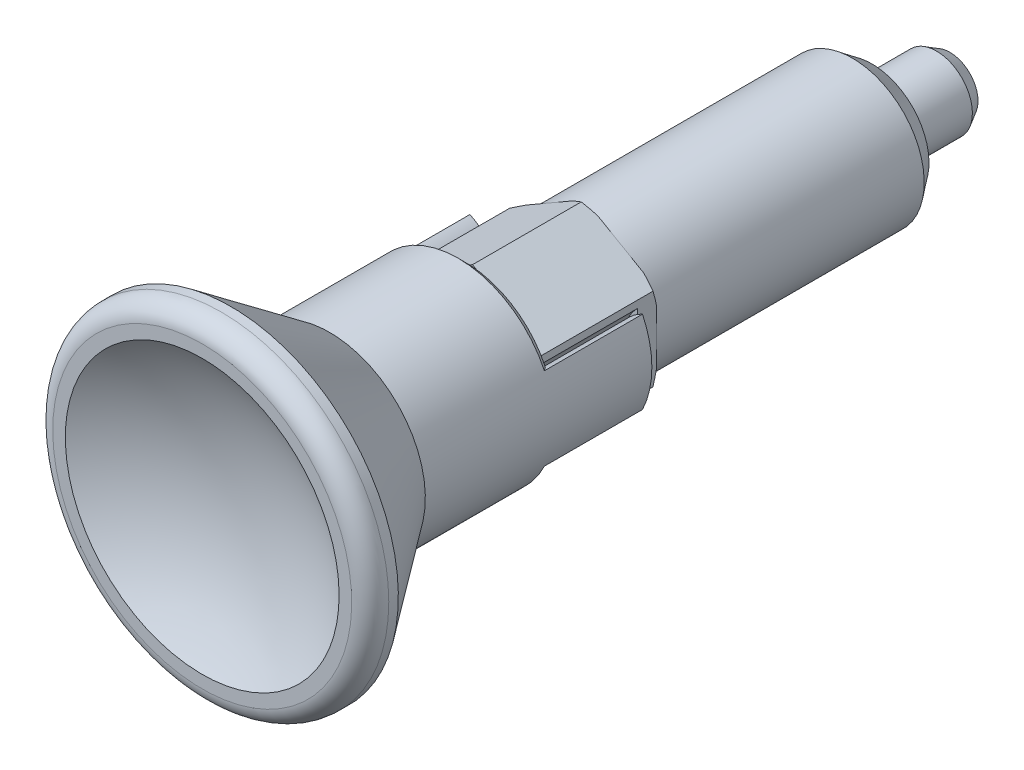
ISO-10303-21;
HEADER;
FILE_DESCRIPTION(('STEP AP214'),'2;1');
FILE_NAME('part.step','',(''),(''),'','','');
FILE_SCHEMA(('AUTOMOTIVE_DESIGN { 1 0 10303 214 1 1 1 1 }'));
ENDSEC;
DATA;
#1=APPLICATION_CONTEXT('core data for automotive mechanical design processes');
#2=APPLICATION_PROTOCOL_DEFINITION('international standard','automotive_design',2000,#1);
#3=PRODUCT_CONTEXT('',#1,'mechanical');
#4=PRODUCT('Part','Part','',(#3));
#5=PRODUCT_RELATED_PRODUCT_CATEGORY('part','',(#4));
#6=PRODUCT_DEFINITION_FORMATION('','',#4);
#7=PRODUCT_DEFINITION_CONTEXT('part definition',#1,'design');
#8=PRODUCT_DEFINITION('design','',#6,#7);
#9=PRODUCT_DEFINITION_SHAPE('','',#8);
#10=(LENGTH_UNIT() NAMED_UNIT(*) SI_UNIT(.MILLI.,.METRE.));
#11=(NAMED_UNIT(*) PLANE_ANGLE_UNIT() SI_UNIT($,.RADIAN.));
#12=(NAMED_UNIT(*) SI_UNIT($,.STERADIAN.) SOLID_ANGLE_UNIT());
#13=UNCERTAINTY_MEASURE_WITH_UNIT(LENGTH_MEASURE(1.E-05),#10,'distance_accuracy_value','');
#14=(GEOMETRIC_REPRESENTATION_CONTEXT(3) GLOBAL_UNCERTAINTY_ASSIGNED_CONTEXT((#13)) GLOBAL_UNIT_ASSIGNED_CONTEXT((#10,
#11,#12)) REPRESENTATION_CONTEXT('',''));
#15=CARTESIAN_POINT('',(0.,0.,0.));
#16=DIRECTION('',(0.,0.,1.));
#17=DIRECTION('',(1.,0.,0.));
#18=AXIS2_PLACEMENT_3D('',#15,#16,#17);
#19=CARTESIAN_POINT('',(3.,0.,0.));
#20=DIRECTION('',(0.,0.,-1.));
#21=DIRECTION('',(0.,1.,0.));
#22=AXIS2_PLACEMENT_3D('',#19,#20,#21);
#23=PLANE('',#22);
#24=CARTESIAN_POINT('',(0.,0.,4.5475775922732E-12));
#25=DIRECTION('',(0.,0.,1.));
#26=DIRECTION('',(0.,-1.,0.));
#27=AXIS2_PLACEMENT_3D('',#24,#25,#26);
#28=CIRCLE('',#27,3.19999999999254);
#29=CARTESIAN_POINT('',(2.46436507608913,2.04129977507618,6.49740677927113E-12));
#30=VERTEX_POINT('',#29);
#31=CARTESIAN_POINT('',(3.,1.11355287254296,4.22318430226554E-12));
#32=VERTEX_POINT('',#31);
#33=EDGE_CURVE('E225',#30,#32,#28,.F.);
#34=ORIENTED_EDGE('',*,*,#33,.T.);
#35=DIRECTION('',(0.,1.,0.));
#36=VECTOR('',#35,1.);
#37=CARTESIAN_POINT('',(3.,0.,0.));
#38=LINE('',#37,#36);
#39=CARTESIAN_POINT('',(3.,0.,0.));
#40=VERTEX_POINT('',#39);
#41=EDGE_CURVE('E231',#32,#40,#38,.F.);
#42=ORIENTED_EDGE('',*,*,#41,.T.);
#43=CARTESIAN_POINT('',(0.,0.,0.));
#44=DIRECTION('',(0.,0.,1.));
#45=DIRECTION('',(0.,-1.,0.));
#46=AXIS2_PLACEMENT_3D('',#43,#44,#45);
#47=CIRCLE('',#46,3.);
#48=CARTESIAN_POINT('',(1.5,2.59807621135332,0.));
#49=VERTEX_POINT('',#48);
#50=EDGE_CURVE('E1099',#49,#40,#47,.F.);
#51=ORIENTED_EDGE('',*,*,#50,.F.);
#52=DIRECTION('',(0.866025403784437,-0.5,0.));
#53=VECTOR('',#52,1.);
#54=CARTESIAN_POINT('',(1.5,2.59807621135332,0.));
#55=LINE('',#54,#53);
#56=EDGE_CURVE('E249',#49,#30,#55,.T.);
#57=ORIENTED_EDGE('',*,*,#56,.T.);
#58=EDGE_LOOP('',(#34,#42,#51,#57));
#59=FACE_BOUND('',#58,.T.);
#60=ADVANCED_FACE('F14',(#59),#23,.T.);
#61=CARTESIAN_POINT('',(3.,0.,0.));
#62=DIRECTION('',(0.,0.,-1.));
#63=DIRECTION('',(0.,1.,0.));
#64=AXIS2_PLACEMENT_3D('',#61,#62,#63);
#65=PLANE('',#64);
#66=CARTESIAN_POINT('',(0.,0.,4.5475775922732E-12));
#67=DIRECTION('',(0.,0.,1.));
#68=DIRECTION('',(0.,-1.,0.));
#69=AXIS2_PLACEMENT_3D('',#66,#67,#68);
#70=CIRCLE('',#69,3.19999999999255);
#71=CARTESIAN_POINT('',(3.,-1.11355287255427,6.49740677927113E-12));
#72=VERTEX_POINT('',#71);
#73=CARTESIAN_POINT('',(2.46436507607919,-2.04129977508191,4.19022455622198E-12));
#74=VERTEX_POINT('',#73);
#75=EDGE_CURVE('E255',#72,#74,#70,.F.);
#76=ORIENTED_EDGE('',*,*,#75,.T.);
#77=DIRECTION('',(-0.866025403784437,-0.5,0.));
#78=VECTOR('',#77,1.);
#79=CARTESIAN_POINT('',(2.4643650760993,-2.04129977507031,0.));
#80=LINE('',#79,#78);
#81=CARTESIAN_POINT('',(1.5,-2.59807621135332,0.));
#82=VERTEX_POINT('',#81);
#83=EDGE_CURVE('E1118',#74,#82,#80,.T.);
#84=ORIENTED_EDGE('',*,*,#83,.T.);
#85=CARTESIAN_POINT('',(0.,0.,0.));
#86=DIRECTION('',(0.,0.,1.));
#87=DIRECTION('',(0.,-1.,0.));
#88=AXIS2_PLACEMENT_3D('',#85,#86,#87);
#89=CIRCLE('',#88,3.);
#90=EDGE_CURVE('E1139',#40,#82,#89,.F.);
#91=ORIENTED_EDGE('',*,*,#90,.F.);
#92=DIRECTION('',(0.,1.,0.));
#93=VECTOR('',#92,1.);
#94=CARTESIAN_POINT('',(3.,0.,0.));
#95=LINE('',#94,#93);
#96=EDGE_CURVE('E237',#40,#72,#95,.F.);
#97=ORIENTED_EDGE('',*,*,#96,.T.);
#98=EDGE_LOOP('',(#76,#84,#91,#97));
#99=FACE_BOUND('',#98,.T.);
#100=ADVANCED_FACE('F527',(#99),#65,.T.);
#101=CARTESIAN_POINT('',(3.,0.,0.));
#102=DIRECTION('',(0.,0.,-1.));
#103=DIRECTION('',(0.,1.,0.));
#104=AXIS2_PLACEMENT_3D('',#101,#102,#103);
#105=PLANE('',#104);
#106=CARTESIAN_POINT('',(0.,0.,4.5475775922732E-12));
#107=DIRECTION('',(0.,0.,1.));
#108=DIRECTION('',(0.,-1.,0.));
#109=AXIS2_PLACEMENT_3D('',#106,#107,#108);
#110=CIRCLE('',#109,3.19999999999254);
#111=CARTESIAN_POINT('',(0.535634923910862,-3.15485264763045,6.49567205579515E-12));
#112=VERTEX_POINT('',#111);
#113=CARTESIAN_POINT('',(-0.535634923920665,-3.1548526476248,4.22318430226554E-12));
#114=VERTEX_POINT('',#113);
#115=EDGE_CURVE('E1114',#112,#114,#110,.F.);
#116=ORIENTED_EDGE('',*,*,#115,.T.);
#117=DIRECTION('',(-0.86602540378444,0.5,0.));
#118=VECTOR('',#117,1.);
#119=CARTESIAN_POINT('',(-0.535634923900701,-3.15485264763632,0.));
#120=LINE('',#119,#118);
#121=CARTESIAN_POINT('',(-1.5,-2.59807621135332,0.));
#122=VERTEX_POINT('',#121);
#123=EDGE_CURVE('E1111',#114,#122,#120,.T.);
#124=ORIENTED_EDGE('',*,*,#123,.T.);
#125=CARTESIAN_POINT('',(0.,0.,0.));
#126=DIRECTION('',(0.,0.,1.));
#127=DIRECTION('',(0.,-1.,0.));
#128=AXIS2_PLACEMENT_3D('',#125,#126,#127);
#129=CIRCLE('',#128,3.);
#130=EDGE_CURVE('E1134',#82,#122,#129,.F.);
#131=ORIENTED_EDGE('',*,*,#130,.F.);
#132=DIRECTION('',(-0.86602540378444,-0.5,0.));
#133=VECTOR('',#132,1.);
#134=CARTESIAN_POINT('',(1.5,-2.59807621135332,0.));
#135=LINE('',#134,#133);
#136=EDGE_CURVE('E1115',#82,#112,#135,.T.);
#137=ORIENTED_EDGE('',*,*,#136,.T.);
#138=EDGE_LOOP('',(#116,#124,#131,#137));
#139=FACE_BOUND('',#138,.T.);
#140=ADVANCED_FACE('F535',(#139),#105,.T.);
#141=CARTESIAN_POINT('',(3.,0.,0.));
#142=DIRECTION('',(0.,0.,-1.));
#143=DIRECTION('',(0.,1.,0.));
#144=AXIS2_PLACEMENT_3D('',#141,#142,#143);
#145=PLANE('',#144);
#146=CARTESIAN_POINT('',(0.,0.,0.));
#147=DIRECTION('',(0.,0.,1.));
#148=DIRECTION('',(0.,-1.,0.));
#149=AXIS2_PLACEMENT_3D('',#146,#147,#148);
#150=CIRCLE('',#149,3.);
#151=CARTESIAN_POINT('',(-3.,0.,0.));
#152=VERTEX_POINT('',#151);
#153=EDGE_CURVE('E1138',#122,#152,#150,.F.);
#154=ORIENTED_EDGE('',*,*,#153,.F.);
#155=DIRECTION('',(-0.866025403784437,0.5,0.));
#156=VECTOR('',#155,1.);
#157=CARTESIAN_POINT('',(-1.5,-2.59807621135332,0.));
#158=LINE('',#157,#156);
#159=CARTESIAN_POINT('',(-2.46436507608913,-2.04129977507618,6.49740677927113E-12));
#160=VERTEX_POINT('',#159);
#161=EDGE_CURVE('E1104',#122,#160,#158,.T.);
#162=ORIENTED_EDGE('',*,*,#161,.T.);
#163=CARTESIAN_POINT('',(0.,0.,4.5475775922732E-12));
#164=DIRECTION('',(0.,0.,1.));
#165=DIRECTION('',(0.,-1.,0.));
#166=AXIS2_PLACEMENT_3D('',#163,#164,#165);
#167=CIRCLE('',#166,3.19999999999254);
#168=CARTESIAN_POINT('',(-3.,-1.11355287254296,4.22318430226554E-12));
#169=VERTEX_POINT('',#168);
#170=EDGE_CURVE('E1110',#160,#169,#167,.F.);
#171=ORIENTED_EDGE('',*,*,#170,.T.);
#172=DIRECTION('',(0.,1.,0.));
#173=VECTOR('',#172,1.);
#174=CARTESIAN_POINT('',(-3.,0.,0.));
#175=LINE('',#174,#173);
#176=EDGE_CURVE('E1107',#169,#152,#175,.T.);
#177=ORIENTED_EDGE('',*,*,#176,.T.);
#178=EDGE_LOOP('',(#154,#162,#171,#177));
#179=FACE_BOUND('',#178,.T.);
#180=ADVANCED_FACE('F544',(#179),#145,.T.);
#181=CARTESIAN_POINT('',(3.,0.,0.));
#182=DIRECTION('',(0.,0.,-1.));
#183=DIRECTION('',(0.,1.,0.));
#184=AXIS2_PLACEMENT_3D('',#181,#182,#183);
#185=PLANE('',#184);
#186=CARTESIAN_POINT('',(0.,0.,4.5475775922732E-12));
#187=DIRECTION('',(0.,0.,1.));
#188=DIRECTION('',(0.,-1.,0.));
#189=AXIS2_PLACEMENT_3D('',#186,#187,#188);
#190=CIRCLE('',#189,3.19999999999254);
#191=CARTESIAN_POINT('',(-3.,1.11355287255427,6.49740677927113E-12));
#192=VERTEX_POINT('',#191);
#193=CARTESIAN_POINT('',(-2.46436507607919,2.04129977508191,4.19022455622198E-12));
#194=VERTEX_POINT('',#193);
#195=EDGE_CURVE('E1100',#192,#194,#190,.F.);
#196=ORIENTED_EDGE('',*,*,#195,.T.);
#197=DIRECTION('',(0.866025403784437,0.5,0.));
#198=VECTOR('',#197,1.);
#199=CARTESIAN_POINT('',(-2.4643650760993,2.04129977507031,0.));
#200=LINE('',#199,#198);
#201=CARTESIAN_POINT('',(-1.5,2.59807621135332,0.));
#202=VERTEX_POINT('',#201);
#203=EDGE_CURVE('E1097',#194,#202,#200,.T.);
#204=ORIENTED_EDGE('',*,*,#203,.T.);
#205=CARTESIAN_POINT('',(0.,0.,0.));
#206=DIRECTION('',(0.,0.,1.));
#207=DIRECTION('',(0.,-1.,0.));
#208=AXIS2_PLACEMENT_3D('',#205,#206,#207);
#209=CIRCLE('',#208,3.);
#210=EDGE_CURVE('E1203',#152,#202,#209,.F.);
#211=ORIENTED_EDGE('',*,*,#210,.F.);
#212=DIRECTION('',(0.,1.,0.));
#213=VECTOR('',#212,1.);
#214=CARTESIAN_POINT('',(-3.,0.,0.));
#215=LINE('',#214,#213);
#216=EDGE_CURVE('E1101',#152,#192,#215,.T.);
#217=ORIENTED_EDGE('',*,*,#216,.T.);
#218=EDGE_LOOP('',(#196,#204,#211,#217));
#219=FACE_BOUND('',#218,.T.);
#220=ADVANCED_FACE('F553',(#219),#185,.T.);
#221=CARTESIAN_POINT('',(0.,0.,-12.));
#222=DIRECTION('',(0.,0.,1.));
#223=DIRECTION('',(0.,-1.,0.));
#224=AXIS2_PLACEMENT_3D('',#221,#222,#223);
#225=CYLINDRICAL_SURFACE('',#224,3.);
#226=ORIENTED_EDGE('',*,*,#210,.T.);
#227=CARTESIAN_POINT('',(0.,0.,0.));
#228=DIRECTION('',(0.,0.,1.));
#229=DIRECTION('',(0.,-1.,0.));
#230=AXIS2_PLACEMENT_3D('',#227,#228,#229);
#231=CIRCLE('',#230,3.);
#232=EDGE_CURVE('E1094',#49,#202,#231,.T.);
#233=ORIENTED_EDGE('',*,*,#232,.F.);
#234=ORIENTED_EDGE('',*,*,#50,.T.);
#235=ORIENTED_EDGE('',*,*,#90,.T.);
#236=ORIENTED_EDGE('',*,*,#130,.T.);
#237=ORIENTED_EDGE('',*,*,#153,.T.);
#238=EDGE_LOOP('',(#226,#233,#234,#235,#236,#237));
#239=FACE_BOUND('',#238,.T.);
#240=CARTESIAN_POINT('',(0.,0.,-11.1865));
#241=DIRECTION('',(0.,0.,1.));
#242=DIRECTION('',(0.,-1.,0.));
#243=AXIS2_PLACEMENT_3D('',#240,#241,#242);
#244=CIRCLE('',#243,3.);
#245=CARTESIAN_POINT('',(0.,-3.,-11.1865));
#246=VERTEX_POINT('',#245);
#247=EDGE_CURVE('E251',#246,#246,#244,.T.);
#248=ORIENTED_EDGE('',*,*,#247,.T.);
#249=EDGE_LOOP('',(#248));
#250=FACE_BOUND('',#249,.T.);
#251=ADVANCED_FACE('F562',(#239,#250),#225,.T.);
#252=CARTESIAN_POINT('',(3.,0.,0.));
#253=DIRECTION('',(0.,0.,-1.));
#254=DIRECTION('',(0.,1.,0.));
#255=AXIS2_PLACEMENT_3D('',#252,#253,#254);
#256=PLANE('',#255);
#257=CARTESIAN_POINT('',(0.,0.,4.5475775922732E-12));
#258=DIRECTION('',(0.,0.,1.));
#259=DIRECTION('',(0.,-1.,0.));
#260=AXIS2_PLACEMENT_3D('',#257,#258,#259);
#261=CIRCLE('',#260,3.19999999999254);
#262=CARTESIAN_POINT('',(0.535634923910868,3.15485264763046,6.49740677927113E-12));
#263=VERTEX_POINT('',#262);
#264=CARTESIAN_POINT('',(-0.535634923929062,3.15485264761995,2.2733551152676E-12));
#265=VERTEX_POINT('',#264);
#266=EDGE_CURVE('E1093',#263,#265,#261,.T.);
#267=ORIENTED_EDGE('',*,*,#266,.F.);
#268=DIRECTION('',(-0.866025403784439,0.5,0.));
#269=VECTOR('',#268,1.);
#270=CARTESIAN_POINT('',(3.,1.73205080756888,0.));
#271=LINE('',#270,#269);
#272=EDGE_CURVE('E1075',#49,#263,#271,.T.);
#273=ORIENTED_EDGE('',*,*,#272,.F.);
#274=ORIENTED_EDGE('',*,*,#232,.T.);
#275=DIRECTION('',(0.86602540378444,0.5,0.));
#276=VECTOR('',#275,1.);
#277=CARTESIAN_POINT('',(-1.5,2.59807621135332,0.));
#278=LINE('',#277,#276);
#279=EDGE_CURVE('E1091',#202,#265,#278,.T.);
#280=ORIENTED_EDGE('',*,*,#279,.T.);
#281=EDGE_LOOP('',(#267,#273,#274,#280));
#282=FACE_BOUND('',#281,.T.);
#283=ADVANCED_FACE('F571',(#282),#256,.T.);
#284=CARTESIAN_POINT('',(0.,0.,0.153394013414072));
#285=DIRECTION('',(0.,0.,1.));
#286=DIRECTION('',(0.,-1.,0.));
#287=AXIS2_PLACEMENT_3D('',#284,#285,#286);
#288=CONICAL_SURFACE('',#287,3.46568622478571,1.04719755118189);
#289=CARTESIAN_POINT('',(-3.23595769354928E-12,3.46410161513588,0.152479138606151));
#290=CARTESIAN_POINT('',(-0.044189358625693,3.43858887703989,0.137749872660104));
#291=CARTESIAN_POINT('',(-0.0884924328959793,3.41301048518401,0.12346983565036));
#292=CARTESIAN_POINT('',(-0.177307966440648,3.36173281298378,0.0958975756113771));
#293=CARTESIAN_POINT('',(-0.221820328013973,3.33603358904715,0.08260493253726));
#294=CARTESIAN_POINT('',(-0.311076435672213,3.28450155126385,0.0570834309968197));
#295=CARTESIAN_POINT('',(-0.355820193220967,3.25866873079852,0.0448546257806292));
#296=CARTESIAN_POINT('',(-0.445551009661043,3.20686261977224,0.021543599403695));
#297=CARTESIAN_POINT('',(-0.490538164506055,3.18088927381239,0.0104618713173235));
#298=CARTESIAN_POINT('',(-0.535634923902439,3.15485264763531,8.3622345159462E-12));
#299=B_SPLINE_CURVE_WITH_KNOTS('',3,(#289,#290,#291,#292,#293,#294,#295,#296,#297,#298),
.UNSPECIFIED.,.F.,.F.,(4,2,2,2,4),(0.,0.159326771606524,0.318585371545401,0.47785193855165,
0.637186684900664),.UNSPECIFIED.);
#300=CARTESIAN_POINT('',(0.,3.46410161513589,0.152479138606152));
#301=VERTEX_POINT('',#300);
#302=EDGE_CURVE('E1071',#301,#265,#299,.T.);
#303=ORIENTED_EDGE('',*,*,#302,.F.);
#304=CARTESIAN_POINT('',(0.535634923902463,3.15485264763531,8.44636860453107E-12));
#305=CARTESIAN_POINT('',(0.490538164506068,3.18088927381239,0.0104618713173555));
#306=CARTESIAN_POINT('',(0.445551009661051,3.20686261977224,0.0215435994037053));
#307=CARTESIAN_POINT('',(0.355820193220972,3.25866873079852,0.0448546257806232));
#308=CARTESIAN_POINT('',(0.311076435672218,3.28450155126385,0.0570834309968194));
#309=CARTESIAN_POINT('',(0.221820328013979,3.33603358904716,0.0826049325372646));
#310=CARTESIAN_POINT('',(0.177307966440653,3.36173281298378,0.095897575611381));
#311=CARTESIAN_POINT('',(0.0884924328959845,3.41301048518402,0.12346983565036));
#312=CARTESIAN_POINT('',(0.0441893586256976,3.43858887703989,0.137749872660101));
#313=CARTESIAN_POINT('',(3.23962068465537E-12,3.46410161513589,0.152479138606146));
#314=B_SPLINE_CURVE_WITH_KNOTS('',3,(#304,#305,#306,#307,#308,#309,#310,#311,#312,#313),
.UNSPECIFIED.,.F.,.F.,(4,2,2,2,4),(0.,0.159334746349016,0.318601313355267,0.477859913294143,
0.637186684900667),.UNSPECIFIED.);
#315=EDGE_CURVE('E1078',#263,#301,#314,.T.);
#316=ORIENTED_EDGE('',*,*,#315,.F.);
#317=ORIENTED_EDGE('',*,*,#266,.T.);
#318=EDGE_LOOP('',(#303,#316,#317));
#319=FACE_BOUND('',#318,.T.);
#320=ADVANCED_FACE('F580',(#319),#288,.T.);
#321=CARTESIAN_POINT('',(0.,0.,0.153394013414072));
#322=DIRECTION('',(0.,0.,1.));
#323=DIRECTION('',(0.,-1.,0.));
#324=AXIS2_PLACEMENT_3D('',#321,#322,#323);
#325=CONICAL_SURFACE('',#324,3.46568622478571,1.04719755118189);
#326=CARTESIAN_POINT('',(3.23529037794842E-12,-3.46410161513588,0.152479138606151));
#327=CARTESIAN_POINT('',(0.0441893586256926,-3.43858887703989,0.137749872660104));
#328=CARTESIAN_POINT('',(0.0884924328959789,-3.41301048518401,0.12346983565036));
#329=CARTESIAN_POINT('',(0.177307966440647,-3.36173281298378,0.0958975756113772));
#330=CARTESIAN_POINT('',(0.221820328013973,-3.33603358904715,0.0826049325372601));
#331=CARTESIAN_POINT('',(0.311076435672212,-3.28450155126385,0.0570834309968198));
#332=CARTESIAN_POINT('',(0.355820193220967,-3.25866873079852,0.0448546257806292));
#333=CARTESIAN_POINT('',(0.445551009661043,-3.20686261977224,0.021543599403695));
#334=CARTESIAN_POINT('',(0.490538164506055,-3.18088927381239,0.0104618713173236));
#335=CARTESIAN_POINT('',(0.535634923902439,-3.15485264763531,8.3622345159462E-12));
#336=B_SPLINE_CURVE_WITH_KNOTS('',3,(#326,#327,#328,#329,#330,#331,#332,#333,#334,#335),
.UNSPECIFIED.,.F.,.F.,(4,2,2,2,4),(0.,0.159326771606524,0.318585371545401,0.477851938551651,
0.637186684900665),.UNSPECIFIED.);
#337=CARTESIAN_POINT('',(1.61634413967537E-12,-3.46410161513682,0.152479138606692));
#338=VERTEX_POINT('',#337);
#339=EDGE_CURVE('E1011',#338,#112,#336,.T.);
#340=ORIENTED_EDGE('',*,*,#339,.F.);
#341=CARTESIAN_POINT('',(-0.535634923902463,-3.15485264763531,8.44636860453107E-12));
#342=CARTESIAN_POINT('',(-0.490538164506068,-3.18088927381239,0.0104618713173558));
#343=CARTESIAN_POINT('',(-0.445551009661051,-3.20686261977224,0.0215435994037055));
#344=CARTESIAN_POINT('',(-0.355820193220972,-3.25866873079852,0.0448546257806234));
#345=CARTESIAN_POINT('',(-0.311076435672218,-3.28450155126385,0.0570834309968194));
#346=CARTESIAN_POINT('',(-0.221820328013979,-3.33603358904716,0.0826049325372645));
#347=CARTESIAN_POINT('',(-0.177307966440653,-3.36173281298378,0.095897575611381));
#348=CARTESIAN_POINT('',(-0.0884924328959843,-3.41301048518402,0.123469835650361));
#349=CARTESIAN_POINT('',(-0.0441893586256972,-3.43858887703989,0.137749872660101));
#350=CARTESIAN_POINT('',(-3.23940384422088E-12,-3.46410161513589,0.152479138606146));
#351=B_SPLINE_CURVE_WITH_KNOTS('',3,(#341,#342,#343,#344,#345,#346,#347,#348,#349,#350),
.UNSPECIFIED.,.F.,.F.,(4,2,2,2,4),(0.,0.159334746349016,0.318601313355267,0.477859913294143,
0.637186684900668),.UNSPECIFIED.);
#352=EDGE_CURVE('E977',#114,#338,#351,.T.);
#353=ORIENTED_EDGE('',*,*,#352,.F.);
#354=ORIENTED_EDGE('',*,*,#115,.F.);
#355=EDGE_LOOP('',(#340,#353,#354));
#356=FACE_BOUND('',#355,.T.);
#357=ADVANCED_FACE('F589',(#356),#325,.T.);
#358=CARTESIAN_POINT('',(0.,-3.46410161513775,0.));
#359=DIRECTION('',(0.5,-0.866025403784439,0.));
#360=DIRECTION('',(0.866025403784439,0.5,0.));
#361=AXIS2_PLACEMENT_3D('',#358,#359,#360);
#362=PLANE('',#361);
#363=CARTESIAN_POINT('',(3.,-1.73205080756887,4.87684739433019));
#364=CARTESIAN_POINT('',(2.95566248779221,-1.75764908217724,4.88878376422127));
#365=CARTESIAN_POINT('',(2.91124823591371,-1.78329166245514,4.90034446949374));
#366=CARTESIAN_POINT('',(2.82227960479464,-1.83465772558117,4.92264778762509));
#367=CARTESIAN_POINT('',(2.77772527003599,-1.86038118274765,4.93339063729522));
#368=CARTESIAN_POINT('',(2.6884625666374,-1.91191702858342,4.95399883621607));
#369=CARTESIAN_POINT('',(2.64375419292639,-1.9377294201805,4.96386415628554));
#370=CARTESIAN_POINT('',(2.55417624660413,-1.98944727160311,4.98265459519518));
#371=CARTESIAN_POINT('',(2.50930663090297,-2.01535275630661,4.99157943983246));
#372=CARTESIAN_POINT('',(2.46436507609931,-2.0412997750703,5.));
#373=B_SPLINE_CURVE_WITH_KNOTS('',3,(#363,#364,#365,#366,#367,#368,#369,#370,#371,#372),
.UNSPECIFIED.,.F.,.F.,(4,2,2,2,4),(0.,0.157708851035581,0.31537186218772,0.473040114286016,
0.630754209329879),.UNSPECIFIED.);
#374=CARTESIAN_POINT('',(3.,-1.73205080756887,4.87684739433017));
#375=VERTEX_POINT('',#374);
#376=CARTESIAN_POINT('',(2.46436507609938,-2.04129977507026,5.));
#377=VERTEX_POINT('',#376);
#378=EDGE_CURVE('E1004',#375,#377,#373,.T.);
#379=ORIENTED_EDGE('',*,*,#378,.T.);
#380=DIRECTION('',(0.866025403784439,0.5,0.));
#381=VECTOR('',#380,1.);
#382=CARTESIAN_POINT('',(0.,-3.46410161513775,5.));
#383=LINE('',#382,#381);
#384=CARTESIAN_POINT('',(1.17819066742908,-2.78387291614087,5.));
#385=VERTEX_POINT('',#384);
#386=EDGE_CURVE('E997',#377,#385,#383,.F.);
#387=ORIENTED_EDGE('',*,*,#386,.T.);
#388=DIRECTION('',(0.,0.,1.));
#389=VECTOR('',#388,1.);
#390=CARTESIAN_POINT('',(1.17819066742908,-2.78387291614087,0.));
#391=LINE('',#390,#389);
#392=CARTESIAN_POINT('',(1.17819066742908,-2.78387291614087,4.7));
#393=VERTEX_POINT('',#392);
#394=EDGE_CURVE('E1090',#385,#393,#391,.F.);
#395=ORIENTED_EDGE('',*,*,#394,.T.);
#396=DIRECTION('',(0.866025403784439,0.5,0.));
#397=VECTOR('',#396,1.);
#398=CARTESIAN_POINT('',(0.,-3.46410161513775,4.7));
#399=LINE('',#398,#397);
#400=CARTESIAN_POINT('',(0.,-3.46410161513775,4.7));
#401=VERTEX_POINT('',#400);
#402=EDGE_CURVE('E1087',#393,#401,#399,.F.);
#403=ORIENTED_EDGE('',*,*,#402,.T.);
#404=DIRECTION('',(0.,0.,1.));
#405=VECTOR('',#404,1.);
#406=CARTESIAN_POINT('',(0.,-3.46410161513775,0.));
#407=LINE('',#406,#405);
#408=EDGE_CURVE('E1056',#338,#401,#407,.T.);
#409=ORIENTED_EDGE('',*,*,#408,.F.);
#410=ORIENTED_EDGE('',*,*,#339,.T.);
#411=ORIENTED_EDGE('',*,*,#136,.F.);
#412=ORIENTED_EDGE('',*,*,#83,.F.);
#413=CARTESIAN_POINT('',(2.9999999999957,-1.73205080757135,0.152479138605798));
#414=CARTESIAN_POINT('',(2.95581064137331,-1.75756354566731,0.13774987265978));
#415=CARTESIAN_POINT('',(2.91150756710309,-1.78314193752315,0.123469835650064));
#416=CARTESIAN_POINT('',(2.82269203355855,-1.83441960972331,0.0958975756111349));
#417=CARTESIAN_POINT('',(2.77817967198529,-1.8601188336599,0.0826049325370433));
#418=CARTESIAN_POINT('',(2.68892356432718,-1.91165087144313,0.0570834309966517));
#419=CARTESIAN_POINT('',(2.64417980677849,-1.93748369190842,0.0448546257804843));
#420=CARTESIAN_POINT('',(2.55444899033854,-1.98928980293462,0.0215435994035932));
#421=CARTESIAN_POINT('',(2.5094618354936,-2.01526314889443,0.0104618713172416));
#422=CARTESIAN_POINT('',(2.46436507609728,-2.04129977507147,8.29804974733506E-12));
#423=B_SPLINE_CURVE_WITH_KNOTS('',3,(#413,#414,#415,#416,#417,#418,#419,#420,#421,#422),
.UNSPECIFIED.,.F.,.F.,(4,2,2,2,4),(0.,0.159326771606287,0.318585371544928,0.47785193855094,
0.637186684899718),.UNSPECIFIED.);
#424=CARTESIAN_POINT('',(2.99999999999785,-1.73205080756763,0.152479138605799));
#425=VERTEX_POINT('',#424);
#426=EDGE_CURVE('E988',#425,#74,#423,.T.);
#427=ORIENTED_EDGE('',*,*,#426,.F.);
#428=DIRECTION('',(0.,0.,1.));
#429=VECTOR('',#428,1.);
#430=CARTESIAN_POINT('',(3.,-1.73205080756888,0.));
#431=LINE('',#430,#429);
#432=EDGE_CURVE('E955',#375,#425,#431,.F.);
#433=ORIENTED_EDGE('',*,*,#432,.F.);
#434=EDGE_LOOP('',(#379,#387,#395,#403,#409,#410,#411,#412,#427,#433));
#435=FACE_BOUND('',#434,.T.);
#436=ADVANCED_FACE('F637',(#435),#362,.T.);
#437=CARTESIAN_POINT('',(0.,0.,0.153394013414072));
#438=DIRECTION('',(0.,0.,1.));
#439=DIRECTION('',(0.,-1.,0.));
#440=AXIS2_PLACEMENT_3D('',#437,#438,#439);
#441=CONICAL_SURFACE('',#440,3.46568622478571,1.04719755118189);
#442=CARTESIAN_POINT('',(3.,-1.73205080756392,0.1524791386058));
#443=CARTESIAN_POINT('',(3.,-1.68102533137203,0.137749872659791));
#444=CARTESIAN_POINT('',(3.,-1.62986854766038,0.123469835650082));
#445=CARTESIAN_POINT('',(3.,-1.52731320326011,0.0958975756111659));
#446=CARTESIAN_POINT('',(3.,-1.47591475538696,0.0826049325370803));
#447=CARTESIAN_POINT('',(3.,-1.37285067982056,0.0570834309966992));
#448=CARTESIAN_POINT('',(3.,-1.32118503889,0.0448546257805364));
#449=CARTESIAN_POINT('',(3.,-1.21757281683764,0.0215435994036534));
#450=CARTESIAN_POINT('',(3.,-1.16562612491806,0.0104618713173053));
#451=CARTESIAN_POINT('',(3.,-1.113552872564,8.36483660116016E-12));
#452=B_SPLINE_CURVE_WITH_KNOTS('',3,(#442,#443,#444,#445,#446,#447,#448,#449,#450,#451),
.UNSPECIFIED.,.F.,.F.,(4,2,2,2,4),(0.,0.159326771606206,0.318585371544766,0.477851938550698,
0.637186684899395),.UNSPECIFIED.);
#453=EDGE_CURVE('E246',#425,#72,#452,.T.);
#454=ORIENTED_EDGE('',*,*,#453,.F.);
#455=ORIENTED_EDGE('',*,*,#426,.T.);
#456=ORIENTED_EDGE('',*,*,#75,.F.);
#457=EDGE_LOOP('',(#454,#455,#456));
#458=FACE_BOUND('',#457,.T.);
#459=ADVANCED_FACE('F632',(#458),#441,.T.);
#460=CARTESIAN_POINT('',(0.,0.,0.153394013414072));
#461=DIRECTION('',(0.,0.,1.));
#462=DIRECTION('',(0.,-1.,0.));
#463=AXIS2_PLACEMENT_3D('',#460,#461,#462);
#464=CONICAL_SURFACE('',#463,3.46568622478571,1.04719755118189);
#465=CARTESIAN_POINT('',(2.99999999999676,1.73205080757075,0.152479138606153));
#466=CARTESIAN_POINT('',(2.9558106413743,1.75756354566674,0.137749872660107));
#467=CARTESIAN_POINT('',(2.91150756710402,1.78314193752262,0.123469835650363));
#468=CARTESIAN_POINT('',(2.82269203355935,1.83441960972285,0.0958975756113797));
#469=CARTESIAN_POINT('',(2.77817967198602,1.86011883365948,0.0826049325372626));
#470=CARTESIAN_POINT('',(2.68892356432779,1.91165087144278,0.0570834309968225));
#471=CARTESIAN_POINT('',(2.64417980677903,1.93748369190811,0.0448546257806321));
#472=CARTESIAN_POINT('',(2.55444899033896,1.98928980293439,0.0215435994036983));
#473=CARTESIAN_POINT('',(2.50946183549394,2.01526314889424,0.010461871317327));
#474=CARTESIAN_POINT('',(2.46436507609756,2.04129977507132,8.36570396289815E-12));
#475=B_SPLINE_CURVE_WITH_KNOTS('',3,(#465,#466,#467,#468,#469,#470,#471,#472,#473,#474),
.UNSPECIFIED.,.F.,.F.,(4,2,2,2,4),(0.,0.159326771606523,0.318585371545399,0.477851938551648,
0.637186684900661),.UNSPECIFIED.);
#476=CARTESIAN_POINT('',(2.99999999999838,1.73205080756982,0.152479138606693));
#477=VERTEX_POINT('',#476);
#478=EDGE_CURVE('E243',#477,#30,#475,.T.);
#479=ORIENTED_EDGE('',*,*,#478,.F.);
#480=CARTESIAN_POINT('',(3.,1.11355287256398,8.44550124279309E-12));
#481=CARTESIAN_POINT('',(3.,1.16562612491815,0.0104618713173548));
#482=CARTESIAN_POINT('',(3.,1.21757281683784,0.0215435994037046));
#483=CARTESIAN_POINT('',(3.,1.32118503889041,0.0448546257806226));
#484=CARTESIAN_POINT('',(3.,1.37285067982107,0.0570834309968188));
#485=CARTESIAN_POINT('',(3.,1.47591475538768,0.0826049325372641));
#486=CARTESIAN_POINT('',(3.,1.52731320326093,0.0958975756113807));
#487=CARTESIAN_POINT('',(3.,1.6298685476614,0.12346983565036));
#488=CARTESIAN_POINT('',(3.,1.68102533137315,0.137749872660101));
#489=CARTESIAN_POINT('',(3.,1.73205080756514,0.152479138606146));
#490=B_SPLINE_CURVE_WITH_KNOTS('',3,(#480,#481,#482,#483,#484,#485,#486,#487,#488,#489),
.UNSPECIFIED.,.F.,.F.,(4,2,2,2,4),(0.,0.159334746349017,0.318601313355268,0.477859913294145,
0.637186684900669),.UNSPECIFIED.);
#491=EDGE_CURVE('E234',#32,#477,#490,.T.);
#492=ORIENTED_EDGE('',*,*,#491,.F.);
#493=ORIENTED_EDGE('',*,*,#33,.F.);
#494=EDGE_LOOP('',(#479,#492,#493));
#495=FACE_BOUND('',#494,.T.);
#496=ADVANCED_FACE('F242',(#495),#464,.T.);
#497=CARTESIAN_POINT('',(3.,1.73205080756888,0.));
#498=DIRECTION('',(0.5,0.866025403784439,0.));
#499=DIRECTION('',(-0.866025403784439,0.5,0.));
#500=AXIS2_PLACEMENT_3D('',#497,#498,#499);
#501=PLANE('',#500);
#502=DIRECTION('',(0.,0.,1.));
#503=VECTOR('',#502,1.);
#504=CARTESIAN_POINT('',(0.,3.46410161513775,0.));
#505=LINE('',#504,#503);
#506=CARTESIAN_POINT('',(0.,3.46410161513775,4.7));
#507=VERTEX_POINT('',#506);
#508=EDGE_CURVE('E1068',#507,#301,#505,.F.);
#509=ORIENTED_EDGE('',*,*,#508,.F.);
#510=DIRECTION('',(-0.86602540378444,0.5,0.));
#511=VECTOR('',#510,1.);
#512=CARTESIAN_POINT('',(1.17819066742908,2.78387291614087,4.7));
#513=LINE('',#512,#511);
#514=CARTESIAN_POINT('',(1.17819066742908,2.78387291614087,4.7));
#515=VERTEX_POINT('',#514);
#516=EDGE_CURVE('E1053',#515,#507,#513,.T.);
#517=ORIENTED_EDGE('',*,*,#516,.F.);
#518=DIRECTION('',(0.,0.,1.));
#519=VECTOR('',#518,1.);
#520=CARTESIAN_POINT('',(1.17819066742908,2.78387291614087,0.));
#521=LINE('',#520,#519);
#522=CARTESIAN_POINT('',(1.17819066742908,2.78387291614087,5.));
#523=VERTEX_POINT('',#522);
#524=EDGE_CURVE('E996',#515,#523,#521,.T.);
#525=ORIENTED_EDGE('',*,*,#524,.T.);
#526=DIRECTION('',(-0.866025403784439,0.5,0.));
#527=VECTOR('',#526,1.);
#528=CARTESIAN_POINT('',(3.,1.73205080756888,5.));
#529=LINE('',#528,#527);
#530=CARTESIAN_POINT('',(2.46436507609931,2.04129977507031,5.));
#531=VERTEX_POINT('',#530);
#532=EDGE_CURVE('E1079',#523,#531,#529,.F.);
#533=ORIENTED_EDGE('',*,*,#532,.T.);
#534=CARTESIAN_POINT('',(2.46436507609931,2.04129977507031,5.));
#535=CARTESIAN_POINT('',(2.50930663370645,2.01535275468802,4.9915794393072));
#536=CARTESIAN_POINT('',(2.55417625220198,1.9894472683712,4.98265459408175));
#537=CARTESIAN_POINT('',(2.64375420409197,1.93772941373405,4.96386415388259));
#538=CARTESIAN_POINT('',(2.68846258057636,1.91191702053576,4.95399883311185));
#539=CARTESIAN_POINT('',(2.77772528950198,1.86038117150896,4.93339063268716));
#540=CARTESIAN_POINT('',(2.82227962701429,1.83465771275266,4.92264778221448));
#541=CARTESIAN_POINT('',(2.91124826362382,1.78329164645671,4.90034446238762));
#542=CARTESIAN_POINT('',(2.95566251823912,1.75764906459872,4.88878375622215));
#543=CARTESIAN_POINT('',(3.00000003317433,1.73205078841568,4.8768473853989));
#544=B_SPLINE_CURVE_WITH_KNOTS('',3,(#534,#535,#536,#537,#538,#539,#540,#541,#542,#543),
.UNSPECIFIED.,.F.,.F.,(4,2,2,2,4),(0.,0.15771410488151,0.315382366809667,0.47304538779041,
0.630754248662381),.UNSPECIFIED.);
#545=CARTESIAN_POINT('',(3.00000001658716,1.73205079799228,4.87684738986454));
#546=VERTEX_POINT('',#545);
#547=EDGE_CURVE('E998',#531,#546,#544,.T.);
#548=ORIENTED_EDGE('',*,*,#547,.T.);
#549=DIRECTION('',(0.,0.,1.));
#550=VECTOR('',#549,1.);
#551=CARTESIAN_POINT('',(3.,1.73205080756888,0.));
#552=LINE('',#551,#550);
#553=EDGE_CURVE('E245',#477,#546,#552,.T.);
#554=ORIENTED_EDGE('',*,*,#553,.F.);
#555=ORIENTED_EDGE('',*,*,#478,.T.);
#556=ORIENTED_EDGE('',*,*,#56,.F.);
#557=ORIENTED_EDGE('',*,*,#272,.T.);
#558=ORIENTED_EDGE('',*,*,#315,.T.);
#559=EDGE_LOOP('',(#509,#517,#525,#533,#548,#554,#555,#556,#557,#558));
#560=FACE_BOUND('',#559,.T.);
#561=ADVANCED_FACE('F601',(#560),#501,.T.);
#562=CARTESIAN_POINT('',(0.,3.46410161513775,0.));
#563=DIRECTION('',(-0.5,0.866025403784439,0.));
#564=DIRECTION('',(-0.866025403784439,-0.5,0.));
#565=AXIS2_PLACEMENT_3D('',#562,#563,#564);
#566=PLANE('',#565);
#567=CARTESIAN_POINT('',(-3.,1.73205080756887,4.87684739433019));
#568=CARTESIAN_POINT('',(-2.95566248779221,1.75764908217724,4.88878376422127));
#569=CARTESIAN_POINT('',(-2.91124823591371,1.78329166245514,4.90034446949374));
#570=CARTESIAN_POINT('',(-2.82227960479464,1.83465772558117,4.92264778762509));
#571=CARTESIAN_POINT('',(-2.77772527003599,1.86038118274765,4.93339063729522));
#572=CARTESIAN_POINT('',(-2.6884625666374,1.91191702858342,4.95399883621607));
#573=CARTESIAN_POINT('',(-2.64375419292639,1.9377294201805,4.96386415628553));
#574=CARTESIAN_POINT('',(-2.55417624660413,1.98944727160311,4.98265459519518));
#575=CARTESIAN_POINT('',(-2.50930663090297,2.01535275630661,4.99157943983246));
#576=CARTESIAN_POINT('',(-2.46436507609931,2.0412997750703,5.));
#577=B_SPLINE_CURVE_WITH_KNOTS('',3,(#567,#568,#569,#570,#571,#572,#573,#574,#575,#576),
.UNSPECIFIED.,.F.,.F.,(4,2,2,2,4),(0.,0.157708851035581,0.31537186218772,0.473040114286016,
0.630754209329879),.UNSPECIFIED.);
#578=CARTESIAN_POINT('',(-3.,1.73205080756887,4.87684739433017));
#579=VERTEX_POINT('',#578);
#580=CARTESIAN_POINT('',(-2.46436507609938,2.04129977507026,5.));
#581=VERTEX_POINT('',#580);
#582=EDGE_CURVE('E1067',#579,#581,#577,.T.);
#583=ORIENTED_EDGE('',*,*,#582,.T.);
#584=DIRECTION('',(-0.866025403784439,-0.5,0.));
#585=VECTOR('',#584,1.);
#586=CARTESIAN_POINT('',(0.,3.46410161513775,5.));
#587=LINE('',#586,#585);
#588=CARTESIAN_POINT('',(-1.17819066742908,2.78387291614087,5.));
#589=VERTEX_POINT('',#588);
#590=EDGE_CURVE('E1063',#581,#589,#587,.F.);
#591=ORIENTED_EDGE('',*,*,#590,.T.);
#592=DIRECTION('',(0.,0.,1.));
#593=VECTOR('',#592,1.);
#594=CARTESIAN_POINT('',(-1.17819066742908,2.78387291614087,0.));
#595=LINE('',#594,#593);
#596=CARTESIAN_POINT('',(-1.17819066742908,2.78387291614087,4.7));
#597=VERTEX_POINT('',#596);
#598=EDGE_CURVE('E1072',#589,#597,#595,.F.);
#599=ORIENTED_EDGE('',*,*,#598,.T.);
#600=DIRECTION('',(-0.86602540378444,-0.5,0.));
#601=VECTOR('',#600,1.);
#602=CARTESIAN_POINT('',(0.,3.46410161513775,4.7));
#603=LINE('',#602,#601);
#604=EDGE_CURVE('E1045',#507,#597,#603,.T.);
#605=ORIENTED_EDGE('',*,*,#604,.F.);
#606=ORIENTED_EDGE('',*,*,#508,.T.);
#607=ORIENTED_EDGE('',*,*,#302,.T.);
#608=ORIENTED_EDGE('',*,*,#279,.F.);
#609=ORIENTED_EDGE('',*,*,#203,.F.);
#610=CARTESIAN_POINT('',(-2.9999999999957,1.73205080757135,0.152479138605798));
#611=CARTESIAN_POINT('',(-2.95581064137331,1.75756354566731,0.13774987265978));
#612=CARTESIAN_POINT('',(-2.91150756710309,1.78314193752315,0.123469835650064));
#613=CARTESIAN_POINT('',(-2.82269203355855,1.83441960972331,0.0958975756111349));
#614=CARTESIAN_POINT('',(-2.77817967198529,1.8601188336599,0.0826049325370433));
#615=CARTESIAN_POINT('',(-2.68892356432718,1.91165087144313,0.0570834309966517));
#616=CARTESIAN_POINT('',(-2.64417980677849,1.93748369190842,0.0448546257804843));
#617=CARTESIAN_POINT('',(-2.55444899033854,1.98928980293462,0.0215435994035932));
#618=CARTESIAN_POINT('',(-2.5094618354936,2.01526314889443,0.0104618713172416));
#619=CARTESIAN_POINT('',(-2.46436507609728,2.04129977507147,8.29804974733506E-12));
#620=B_SPLINE_CURVE_WITH_KNOTS('',3,(#610,#611,#612,#613,#614,#615,#616,#617,#618,#619),
.UNSPECIFIED.,.F.,.F.,(4,2,2,2,4),(0.,0.159326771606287,0.318585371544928,0.47785193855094,
0.637186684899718),.UNSPECIFIED.);
#621=CARTESIAN_POINT('',(-2.99999999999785,1.73205080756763,0.152479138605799));
#622=VERTEX_POINT('',#621);
#623=EDGE_CURVE('E1066',#622,#194,#620,.T.);
#624=ORIENTED_EDGE('',*,*,#623,.F.);
#625=DIRECTION('',(0.,0.,1.));
#626=VECTOR('',#625,1.);
#627=CARTESIAN_POINT('',(-3.,1.73205080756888,0.));
#628=LINE('',#627,#626);
#629=EDGE_CURVE('E1192',#579,#622,#628,.F.);
#630=ORIENTED_EDGE('',*,*,#629,.F.);
#631=EDGE_LOOP('',(#583,#591,#599,#605,#606,#607,#608,#609,#624,#630));
#632=FACE_BOUND('',#631,.T.);
#633=ADVANCED_FACE('F595',(#632),#566,.T.);
#634=CARTESIAN_POINT('',(0.,0.,0.153394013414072));
#635=DIRECTION('',(0.,0.,1.));
#636=DIRECTION('',(0.,-1.,0.));
#637=AXIS2_PLACEMENT_3D('',#634,#635,#636);
#638=CONICAL_SURFACE('',#637,3.46568622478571,1.04719755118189);
#639=CARTESIAN_POINT('',(-3.,1.73205080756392,0.1524791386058));
#640=CARTESIAN_POINT('',(-3.,1.68102533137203,0.137749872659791));
#641=CARTESIAN_POINT('',(-3.,1.62986854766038,0.123469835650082));
#642=CARTESIAN_POINT('',(-3.,1.52731320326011,0.0958975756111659));
#643=CARTESIAN_POINT('',(-3.,1.47591475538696,0.0826049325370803));
#644=CARTESIAN_POINT('',(-3.,1.37285067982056,0.0570834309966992));
#645=CARTESIAN_POINT('',(-3.,1.32118503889,0.0448546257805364));
#646=CARTESIAN_POINT('',(-3.,1.21757281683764,0.0215435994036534));
#647=CARTESIAN_POINT('',(-3.,1.16562612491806,0.0104618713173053));
#648=CARTESIAN_POINT('',(-3.,1.113552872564,8.36483660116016E-12));
#649=B_SPLINE_CURVE_WITH_KNOTS('',3,(#639,#640,#641,#642,#643,#644,#645,#646,#647,#648),
.UNSPECIFIED.,.F.,.F.,(4,2,2,2,4),(0.,0.159326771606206,0.318585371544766,0.477851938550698,
0.637186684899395),.UNSPECIFIED.);
#650=EDGE_CURVE('E1179',#622,#192,#649,.T.);
#651=ORIENTED_EDGE('',*,*,#650,.F.);
#652=ORIENTED_EDGE('',*,*,#623,.T.);
#653=ORIENTED_EDGE('',*,*,#195,.F.);
#654=EDGE_LOOP('',(#651,#652,#653));
#655=FACE_BOUND('',#654,.T.);
#656=ADVANCED_FACE('F600',(#655),#638,.T.);
#657=CARTESIAN_POINT('',(0.,0.,0.153394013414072));
#658=DIRECTION('',(0.,0.,1.));
#659=DIRECTION('',(0.,-1.,0.));
#660=AXIS2_PLACEMENT_3D('',#657,#658,#659);
#661=CONICAL_SURFACE('',#660,3.46568622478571,1.04719755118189);
#662=CARTESIAN_POINT('',(-3.,-1.11355287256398,8.44550124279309E-12));
#663=CARTESIAN_POINT('',(-3.,-1.16562612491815,0.0104618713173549));
#664=CARTESIAN_POINT('',(-3.,-1.21757281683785,0.0215435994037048));
#665=CARTESIAN_POINT('',(-3.,-1.32118503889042,0.0448546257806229));
#666=CARTESIAN_POINT('',(-3.,-1.37285067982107,0.0570834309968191));
#667=CARTESIAN_POINT('',(-3.,-1.47591475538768,0.0826049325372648));
#668=CARTESIAN_POINT('',(-3.,-1.52731320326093,0.0958975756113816));
#669=CARTESIAN_POINT('',(-3.,-1.6298685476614,0.123469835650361));
#670=CARTESIAN_POINT('',(-3.,-1.68102533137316,0.137749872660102));
#671=CARTESIAN_POINT('',(-3.,-1.73205080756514,0.152479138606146));
#672=B_SPLINE_CURVE_WITH_KNOTS('',3,(#662,#663,#664,#665,#666,#667,#668,#669,#670,#671),
.UNSPECIFIED.,.F.,.F.,(4,2,2,2,4),(0.,0.159334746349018,0.31860131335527,0.477859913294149,
0.637186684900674),.UNSPECIFIED.);
#673=CARTESIAN_POINT('',(-2.99999999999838,-1.73205080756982,0.152479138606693));
#674=VERTEX_POINT('',#673);
#675=EDGE_CURVE('E1157',#169,#674,#672,.T.);
#676=ORIENTED_EDGE('',*,*,#675,.F.);
#677=ORIENTED_EDGE('',*,*,#170,.F.);
#678=CARTESIAN_POINT('',(-2.99999999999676,-1.73205080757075,0.152479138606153));
#679=CARTESIAN_POINT('',(-2.9558106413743,-1.75756354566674,0.137749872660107));
#680=CARTESIAN_POINT('',(-2.91150756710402,-1.78314193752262,0.123469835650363));
#681=CARTESIAN_POINT('',(-2.82269203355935,-1.83441960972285,0.0958975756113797));
#682=CARTESIAN_POINT('',(-2.77817967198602,-1.86011883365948,0.0826049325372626));
#683=CARTESIAN_POINT('',(-2.68892356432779,-1.91165087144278,0.0570834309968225));
#684=CARTESIAN_POINT('',(-2.64417980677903,-1.93748369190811,0.0448546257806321));
#685=CARTESIAN_POINT('',(-2.55444899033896,-1.98928980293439,0.0215435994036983));
#686=CARTESIAN_POINT('',(-2.50946183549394,-2.01526314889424,0.010461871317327));
#687=CARTESIAN_POINT('',(-2.46436507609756,-2.04129977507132,8.36570396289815E-12));
#688=B_SPLINE_CURVE_WITH_KNOTS('',3,(#678,#679,#680,#681,#682,#683,#684,#685,#686,#687),
.UNSPECIFIED.,.F.,.F.,(4,2,2,2,4),(0.,0.159326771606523,0.318585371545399,0.477851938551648,
0.637186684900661),.UNSPECIFIED.);
#689=EDGE_CURVE('E1154',#674,#160,#688,.T.);
#690=ORIENTED_EDGE('',*,*,#689,.F.);
#691=EDGE_LOOP('',(#676,#677,#690));
#692=FACE_BOUND('',#691,.T.);
#693=ADVANCED_FACE('F747',(#692),#661,.T.);
#694=CARTESIAN_POINT('',(-3.,-1.73205080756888,0.));
#695=DIRECTION('',(-0.5,-0.866025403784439,0.));
#696=DIRECTION('',(0.866025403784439,-0.5,0.));
#697=AXIS2_PLACEMENT_3D('',#694,#695,#696);
#698=PLANE('',#697);
#699=ORIENTED_EDGE('',*,*,#408,.T.);
#700=DIRECTION('',(0.86602540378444,-0.5,0.));
#701=VECTOR('',#700,1.);
#702=CARTESIAN_POINT('',(-1.17819066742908,-2.78387291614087,4.7));
#703=LINE('',#702,#701);
#704=CARTESIAN_POINT('',(-1.17819066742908,-2.78387291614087,4.7));
#705=VERTEX_POINT('',#704);
#706=EDGE_CURVE('E934',#705,#401,#703,.T.);
#707=ORIENTED_EDGE('',*,*,#706,.F.);
#708=DIRECTION('',(0.,0.,1.));
#709=VECTOR('',#708,1.);
#710=CARTESIAN_POINT('',(-1.17819066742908,-2.78387291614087,0.));
#711=LINE('',#710,#709);
#712=CARTESIAN_POINT('',(-1.17819066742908,-2.78387291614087,5.));
#713=VERTEX_POINT('',#712);
#714=EDGE_CURVE('E1062',#705,#713,#711,.T.);
#715=ORIENTED_EDGE('',*,*,#714,.T.);
#716=DIRECTION('',(0.866025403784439,-0.5,0.));
#717=VECTOR('',#716,1.);
#718=CARTESIAN_POINT('',(-3.,-1.73205080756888,5.));
#719=LINE('',#718,#717);
#720=CARTESIAN_POINT('',(-2.46436507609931,-2.04129977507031,5.));
#721=VERTEX_POINT('',#720);
#722=EDGE_CURVE('E1059',#713,#721,#719,.F.);
#723=ORIENTED_EDGE('',*,*,#722,.T.);
#724=CARTESIAN_POINT('',(-2.46436507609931,-2.04129977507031,5.));
#725=CARTESIAN_POINT('',(-2.50930663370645,-2.01535275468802,4.9915794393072));
#726=CARTESIAN_POINT('',(-2.55417625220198,-1.9894472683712,4.98265459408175));
#727=CARTESIAN_POINT('',(-2.64375420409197,-1.93772941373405,4.96386415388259));
#728=CARTESIAN_POINT('',(-2.68846258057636,-1.91191702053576,4.95399883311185));
#729=CARTESIAN_POINT('',(-2.77772528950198,-1.86038117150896,4.93339063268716));
#730=CARTESIAN_POINT('',(-2.82227962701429,-1.83465771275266,4.92264778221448));
#731=CARTESIAN_POINT('',(-2.91124826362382,-1.78329164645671,4.90034446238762));
#732=CARTESIAN_POINT('',(-2.95566251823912,-1.75764906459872,4.88878375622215));
#733=CARTESIAN_POINT('',(-3.00000003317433,-1.73205078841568,4.8768473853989));
#734=B_SPLINE_CURVE_WITH_KNOTS('',3,(#724,#725,#726,#727,#728,#729,#730,#731,#732,#733),
.UNSPECIFIED.,.F.,.F.,(4,2,2,2,4),(0.,0.15771410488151,0.315382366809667,0.47304538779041,
0.630754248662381),.UNSPECIFIED.);
#735=CARTESIAN_POINT('',(-3.00000001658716,-1.73205079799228,4.87684738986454));
#736=VERTEX_POINT('',#735);
#737=EDGE_CURVE('E1061',#721,#736,#734,.T.);
#738=ORIENTED_EDGE('',*,*,#737,.T.);
#739=DIRECTION('',(0.,0.,1.));
#740=VECTOR('',#739,1.);
#741=CARTESIAN_POINT('',(-3.,-1.73205080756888,0.));
#742=LINE('',#741,#740);
#743=EDGE_CURVE('E1159',#674,#736,#742,.T.);
#744=ORIENTED_EDGE('',*,*,#743,.F.);
#745=ORIENTED_EDGE('',*,*,#689,.T.);
#746=ORIENTED_EDGE('',*,*,#161,.F.);
#747=ORIENTED_EDGE('',*,*,#123,.F.);
#748=ORIENTED_EDGE('',*,*,#352,.T.);
#749=EDGE_LOOP('',(#699,#707,#715,#723,#738,#744,#745,#746,#747,#748));
#750=FACE_BOUND('',#749,.T.);
#751=ADVANCED_FACE('F738',(#750),#698,.T.);
#752=CARTESIAN_POINT('',(0.,0.,4.7));
#753=DIRECTION('',(0.,0.,1.));
#754=DIRECTION('',(0.,-1.,0.));
#755=AXIS2_PLACEMENT_3D('',#752,#753,#754);
#756=PLANE('',#755);
#757=ORIENTED_EDGE('',*,*,#516,.T.);
#758=ORIENTED_EDGE('',*,*,#604,.T.);
#759=CARTESIAN_POINT('',(0.,4.4,4.7));
#760=DIRECTION('',(0.,0.,-1.));
#761=DIRECTION('',(0.,1.,0.));
#762=AXIS2_PLACEMENT_3D('',#759,#760,#761);
#763=CIRCLE('',#762,2.);
#764=EDGE_CURVE('E1044',#597,#515,#763,.F.);
#765=ORIENTED_EDGE('',*,*,#764,.T.);
#766=EDGE_LOOP('',(#757,#758,#765));
#767=FACE_BOUND('',#766,.T.);
#768=ADVANCED_FACE('F729',(#767),#756,.T.);
#769=CARTESIAN_POINT('',(0.,0.,0.8));
#770=DIRECTION('',(0.,0.,1.));
#771=DIRECTION('',(0.,-1.,0.));
#772=AXIS2_PLACEMENT_3D('',#769,#770,#771);
#773=PLANE('',#772);
#774=CARTESIAN_POINT('',(4.4,0.,0.8));
#775=DIRECTION('',(0.,0.,-1.));
#776=DIRECTION('',(0.,1.,0.));
#777=AXIS2_PLACEMENT_3D('',#774,#775,#776);
#778=CIRCLE('',#777,2.);
#779=CARTESIAN_POINT('',(3.,1.42828568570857,0.8));
#780=VERTEX_POINT('',#779);
#781=CARTESIAN_POINT('',(3.,-1.42828568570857,0.8));
#782=VERTEX_POINT('',#781);
#783=EDGE_CURVE('E946',#780,#782,#778,.F.);
#784=ORIENTED_EDGE('',*,*,#783,.T.);
#785=DIRECTION('',(0.,1.,0.));
#786=VECTOR('',#785,1.);
#787=CARTESIAN_POINT('',(3.,-1.73205080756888,0.8));
#788=LINE('',#787,#786);
#789=EDGE_CURVE('E956',#780,#782,#788,.F.);
#790=ORIENTED_EDGE('',*,*,#789,.F.);
#791=EDGE_LOOP('',(#784,#790));
#792=FACE_BOUND('',#791,.T.);
#793=ADVANCED_FACE('F626',(#792),#773,.T.);
#794=CARTESIAN_POINT('',(3.,-1.73205080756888,0.));
#795=DIRECTION('',(1.,0.,0.));
#796=DIRECTION('',(0.,1.,0.));
#797=AXIS2_PLACEMENT_3D('',#794,#795,#796);
#798=PLANE('',#797);
#799=ORIENTED_EDGE('',*,*,#553,.T.);
#800=CARTESIAN_POINT('',(3.00000000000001,1.42828568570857,4.94280757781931));
#801=CARTESIAN_POINT('',(2.99999999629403,1.44082144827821,4.94029480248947));
#802=CARTESIAN_POINT('',(2.99999995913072,1.45335201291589,4.93775611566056));
#803=CARTESIAN_POINT('',(2.99999985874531,1.47844595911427,4.93261897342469));
#804=CARTESIAN_POINT('',(2.99999979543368,1.49100930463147,4.93002034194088));
#805=CARTESIAN_POINT('',(2.99999968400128,1.51617051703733,4.92476331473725));
#806=CARTESIAN_POINT('',(2.9999996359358,1.52876834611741,4.92210473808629));
#807=CARTESIAN_POINT('',(2.99999957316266,1.55400019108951,4.91672782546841));
#808=CARTESIAN_POINT('',(2.99999955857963,1.56663416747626,4.91400930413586));
#809=CARTESIAN_POINT('',(2.99999956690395,1.59193992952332,4.90851250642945));
#810=CARTESIAN_POINT('',(2.99999958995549,1.60461167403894,4.90573404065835));
#811=CARTESIAN_POINT('',(2.99999966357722,1.6299945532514,4.9001173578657));
#812=CARTESIAN_POINT('',(2.99999971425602,1.64270564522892,4.89727894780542));
#813=CARTESIAN_POINT('',(2.99999982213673,1.66816875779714,4.89154238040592));
#814=CARTESIAN_POINT('',(2.99999987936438,1.68092073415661,4.88864402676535));
#815=CARTESIAN_POINT('',(2.99999996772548,1.70646711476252,4.88278757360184));
#816=CARTESIAN_POINT('',(2.99999999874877,1.71926147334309,4.87982927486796));
#817=CARTESIAN_POINT('',(3.00000000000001,1.73205035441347,4.87684749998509));
#818=B_SPLINE_CURVE_WITH_KNOTS('',3,(#800,#801,#802,#803,#804,#805,#806,#807,#808,#809,#810,
#811,#812,#813,#814,#815,#816,#817),.UNSPECIFIED.,.F.,.F.,(4,2,2,2,2,2,2,2,4),(0.,
0.038355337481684,0.0768430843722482,0.11546887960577,0.154238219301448,0.193156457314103,
0.232228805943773,0.271460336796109,0.310855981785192),.UNSPECIFIED.);
#819=CARTESIAN_POINT('',(3.,1.42828568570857,4.94280757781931));
#820=VERTEX_POINT('',#819);
#821=EDGE_CURVE('E950',#820,#546,#818,.T.);
#822=ORIENTED_EDGE('',*,*,#821,.F.);
#823=DIRECTION('',(0.,0.,-1.));
#824=VECTOR('',#823,1.);
#825=CARTESIAN_POINT('',(3.,1.42828568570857,0.8));
#826=LINE('',#825,#824);
#827=EDGE_CURVE('E947',#820,#780,#826,.T.);
#828=ORIENTED_EDGE('',*,*,#827,.T.);
#829=ORIENTED_EDGE('',*,*,#789,.T.);
#830=DIRECTION('',(0.,0.,-1.));
#831=VECTOR('',#830,1.);
#832=CARTESIAN_POINT('',(3.,-1.42828568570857,0.8));
#833=LINE('',#832,#831);
#834=CARTESIAN_POINT('',(3.,-1.42828568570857,4.94280757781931));
#835=VERTEX_POINT('',#834);
#836=EDGE_CURVE('E942',#782,#835,#833,.F.);
#837=ORIENTED_EDGE('',*,*,#836,.T.);
#838=CARTESIAN_POINT('',(3.,-1.42828568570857,4.9428075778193));
#839=CARTESIAN_POINT('',(3.,-1.57700265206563,4.91299746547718));
#840=CARTESIAN_POINT('',(3.,-1.73205080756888,4.87684739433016));
#841=B_SPLINE_CURVE_WITH_KNOTS('',2,(#838,#839,#840),.UNSPECIFIED.,.F.,.F.,(3,3),(0.,1.),.UNSPECIFIED.);
#842=EDGE_CURVE('E951',#835,#375,#841,.T.);
#843=ORIENTED_EDGE('',*,*,#842,.T.);
#844=ORIENTED_EDGE('',*,*,#432,.T.);
#845=ORIENTED_EDGE('',*,*,#453,.T.);
#846=ORIENTED_EDGE('',*,*,#96,.F.);
#847=ORIENTED_EDGE('',*,*,#41,.F.);
#848=ORIENTED_EDGE('',*,*,#491,.T.);
#849=EDGE_LOOP('',(#799,#822,#828,#829,#837,#843,#844,#845,#846,#847,#848));
#850=FACE_BOUND('',#849,.T.);
#851=ADVANCED_FACE('F233',(#850),#798,.T.);
#852=CARTESIAN_POINT('',(0.,0.,4.7));
#853=DIRECTION('',(0.,0.,1.));
#854=DIRECTION('',(0.,-1.,0.));
#855=AXIS2_PLACEMENT_3D('',#852,#853,#854);
#856=PLANE('',#855);
#857=ORIENTED_EDGE('',*,*,#706,.T.);
#858=ORIENTED_EDGE('',*,*,#402,.F.);
#859=CARTESIAN_POINT('',(0.,-4.4,4.7));
#860=DIRECTION('',(0.,0.,-1.));
#861=DIRECTION('',(0.,1.,0.));
#862=AXIS2_PLACEMENT_3D('',#859,#860,#861);
#863=CIRCLE('',#862,2.);
#864=EDGE_CURVE('E931',#393,#705,#863,.F.);
#865=ORIENTED_EDGE('',*,*,#864,.T.);
#866=EDGE_LOOP('',(#857,#858,#865));
#867=FACE_BOUND('',#866,.T.);
#868=ADVANCED_FACE('F625',(#867),#856,.T.);
#869=CARTESIAN_POINT('',(0.,0.,0.8));
#870=DIRECTION('',(0.,0.,1.));
#871=DIRECTION('',(0.,-1.,0.));
#872=AXIS2_PLACEMENT_3D('',#869,#870,#871);
#873=PLANE('',#872);
#874=CARTESIAN_POINT('',(-4.4,0.,0.8));
#875=DIRECTION('',(0.,0.,-1.));
#876=DIRECTION('',(0.,1.,0.));
#877=AXIS2_PLACEMENT_3D('',#874,#875,#876);
#878=CIRCLE('',#877,2.);
#879=CARTESIAN_POINT('',(-3.,-1.42828568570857,0.8));
#880=VERTEX_POINT('',#879);
#881=CARTESIAN_POINT('',(-3.,1.42828568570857,0.8));
#882=VERTEX_POINT('',#881);
#883=EDGE_CURVE('E1248',#880,#882,#878,.F.);
#884=ORIENTED_EDGE('',*,*,#883,.T.);
#885=DIRECTION('',(0.,-1.,0.));
#886=VECTOR('',#885,1.);
#887=CARTESIAN_POINT('',(-3.,1.73205080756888,0.8));
#888=LINE('',#887,#886);
#889=EDGE_CURVE('E932',#880,#882,#888,.F.);
#890=ORIENTED_EDGE('',*,*,#889,.F.);
#891=EDGE_LOOP('',(#884,#890));
#892=FACE_BOUND('',#891,.T.);
#893=ADVANCED_FACE('F671',(#892),#873,.T.);
#894=CARTESIAN_POINT('',(-3.,1.73205080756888,0.));
#895=DIRECTION('',(-1.,0.,0.));
#896=DIRECTION('',(0.,-1.,0.));
#897=AXIS2_PLACEMENT_3D('',#894,#895,#896);
#898=PLANE('',#897);
#899=ORIENTED_EDGE('',*,*,#743,.T.);
#900=CARTESIAN_POINT('',(-3.00000000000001,-1.42828568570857,4.94280757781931));
#901=CARTESIAN_POINT('',(-2.99999999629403,-1.44082144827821,4.94029480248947));
#902=CARTESIAN_POINT('',(-2.99999995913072,-1.45335201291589,4.93775611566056));
#903=CARTESIAN_POINT('',(-2.99999985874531,-1.47844595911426,4.93261897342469));
#904=CARTESIAN_POINT('',(-2.99999979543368,-1.49100930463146,4.93002034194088));
#905=CARTESIAN_POINT('',(-2.99999968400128,-1.51617051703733,4.92476331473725));
#906=CARTESIAN_POINT('',(-2.9999996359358,-1.52876834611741,4.92210473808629));
#907=CARTESIAN_POINT('',(-2.99999957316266,-1.55400019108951,4.91672782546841));
#908=CARTESIAN_POINT('',(-2.99999955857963,-1.56663416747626,4.91400930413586));
#909=CARTESIAN_POINT('',(-2.99999956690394,-1.59193992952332,4.90851250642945));
#910=CARTESIAN_POINT('',(-2.99999958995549,-1.60461167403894,4.90573404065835));
#911=CARTESIAN_POINT('',(-2.99999966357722,-1.62999455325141,4.9001173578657));
#912=CARTESIAN_POINT('',(-2.99999971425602,-1.64270564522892,4.89727894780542));
#913=CARTESIAN_POINT('',(-2.99999982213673,-1.66816875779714,4.89154238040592));
#914=CARTESIAN_POINT('',(-2.99999987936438,-1.68092073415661,4.88864402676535));
#915=CARTESIAN_POINT('',(-2.99999996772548,-1.70646711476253,4.88278757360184));
#916=CARTESIAN_POINT('',(-2.99999999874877,-1.7192614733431,4.87982927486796));
#917=CARTESIAN_POINT('',(-3.,-1.73205035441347,4.87684749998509));
#918=B_SPLINE_CURVE_WITH_KNOTS('',3,(#900,#901,#902,#903,#904,#905,#906,#907,#908,#909,#910,
#911,#912,#913,#914,#915,#916,#917),.UNSPECIFIED.,.F.,.F.,(4,2,2,2,2,2,2,2,4),(0.,
0.0383553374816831,0.0768430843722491,0.115468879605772,0.154238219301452,0.193156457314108,
0.232228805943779,0.271460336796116,0.310855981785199),.UNSPECIFIED.);
#919=CARTESIAN_POINT('',(-3.,-1.42828568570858,4.94280757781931));
#920=VERTEX_POINT('',#919);
#921=EDGE_CURVE('E925',#920,#736,#918,.T.);
#922=ORIENTED_EDGE('',*,*,#921,.F.);
#923=DIRECTION('',(0.,0.,-1.));
#924=VECTOR('',#923,1.);
#925=CARTESIAN_POINT('',(-3.,-1.42828568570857,0.8));
#926=LINE('',#925,#924);
#927=EDGE_CURVE('E930',#920,#880,#926,.T.);
#928=ORIENTED_EDGE('',*,*,#927,.T.);
#929=ORIENTED_EDGE('',*,*,#889,.T.);
#930=DIRECTION('',(0.,0.,-1.));
#931=VECTOR('',#930,1.);
#932=CARTESIAN_POINT('',(-3.,1.42828568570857,0.8));
#933=LINE('',#932,#931);
#934=CARTESIAN_POINT('',(-3.,1.42828568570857,4.94280757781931));
#935=VERTEX_POINT('',#934);
#936=EDGE_CURVE('E347',#882,#935,#933,.F.);
#937=ORIENTED_EDGE('',*,*,#936,.T.);
#938=CARTESIAN_POINT('',(-3.,1.42828568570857,4.9428075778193));
#939=CARTESIAN_POINT('',(-3.,1.57700265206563,4.91299746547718));
#940=CARTESIAN_POINT('',(-3.,1.73205080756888,4.87684739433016));
#941=B_SPLINE_CURVE_WITH_KNOTS('',2,(#938,#939,#940),.UNSPECIFIED.,.F.,.F.,(3,3),(0.,1.),.UNSPECIFIED.);
#942=EDGE_CURVE('E1188',#935,#579,#941,.T.);
#943=ORIENTED_EDGE('',*,*,#942,.T.);
#944=ORIENTED_EDGE('',*,*,#629,.T.);
#945=ORIENTED_EDGE('',*,*,#650,.T.);
#946=ORIENTED_EDGE('',*,*,#216,.F.);
#947=ORIENTED_EDGE('',*,*,#176,.F.);
#948=ORIENTED_EDGE('',*,*,#675,.T.);
#949=EDGE_LOOP('',(#899,#922,#928,#929,#937,#943,#944,#945,#946,#947,#948));
#950=FACE_BOUND('',#949,.T.);
#951=ADVANCED_FACE('F666',(#950),#898,.T.);
#952=CARTESIAN_POINT('',(0.,4.4,4.7));
#953=DIRECTION('',(0.,0.,-1.));
#954=DIRECTION('',(0.,1.,0.));
#955=AXIS2_PLACEMENT_3D('',#952,#953,#954);
#956=CYLINDRICAL_SURFACE('',#955,2.);
#957=CARTESIAN_POINT('',(0.,4.4,5.));
#958=DIRECTION('',(0.,0.,-1.));
#959=DIRECTION('',(0.,1.,0.));
#960=AXIS2_PLACEMENT_3D('',#957,#958,#959);
#961=CIRCLE('',#960,2.);
#962=EDGE_CURVE('E903',#589,#523,#961,.F.);
#963=ORIENTED_EDGE('',*,*,#962,.T.);
#964=ORIENTED_EDGE('',*,*,#524,.F.);
#965=ORIENTED_EDGE('',*,*,#764,.F.);
#966=ORIENTED_EDGE('',*,*,#598,.F.);
#967=EDGE_LOOP('',(#963,#964,#965,#966));
#968=FACE_BOUND('',#967,.T.);
#969=ADVANCED_FACE('F660',(#968),#956,.F.);
#970=CARTESIAN_POINT('',(0.,0.,4.87610847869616));
#971=DIRECTION('',(0.,0.,-1.));
#972=DIRECTION('',(0.,1.,0.));
#973=AXIS2_PLACEMENT_3D('',#970,#971,#972);
#974=CONICAL_SURFACE('',#973,3.46568622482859,1.13446401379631);
#975=ORIENTED_EDGE('',*,*,#547,.F.);
#976=CARTESIAN_POINT('',(0.,0.,5.));
#977=DIRECTION('',(0.,0.,-1.));
#978=DIRECTION('',(0.,1.,0.));
#979=AXIS2_PLACEMENT_3D('',#976,#977,#978);
#980=CIRCLE('',#979,3.2);
#981=CARTESIAN_POINT('',(2.90909090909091,1.33311292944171,5.));
#982=VERTEX_POINT('',#981);
#983=EDGE_CURVE('E901',#531,#982,#980,.T.);
#984=ORIENTED_EDGE('',*,*,#983,.T.);
#985=CARTESIAN_POINT('',(2.90909090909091,1.33311292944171,5.));
#986=CARTESIAN_POINT('',(2.92375803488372,1.34951316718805,4.99059343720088));
#987=CARTESIAN_POINT('',(2.93866735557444,1.36564434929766,4.98112412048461));
#988=CARTESIAN_POINT('',(2.96897038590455,1.39736860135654,4.9620599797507));
#989=CARTESIAN_POINT('',(2.98436409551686,1.4129616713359,4.95246515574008));
#990=CARTESIAN_POINT('',(3.,1.42828568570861,4.94280757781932));
#991=B_SPLINE_CURVE_WITH_KNOTS('',3,(#985,#986,#987,#988,#989,#990),.UNSPECIFIED.,.F.,.F.,(4,2,
4),(0.,0.0717602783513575,0.143520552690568),.UNSPECIFIED.);
#992=EDGE_CURVE('E945',#982,#820,#991,.T.);
#993=ORIENTED_EDGE('',*,*,#992,.T.);
#994=ORIENTED_EDGE('',*,*,#821,.T.);
#995=EDGE_LOOP('',(#975,#984,#993,#994));
#996=FACE_BOUND('',#995,.T.);
#997=ADVANCED_FACE('F655',(#996),#974,.T.);
#998=CARTESIAN_POINT('',(4.4,0.,0.8));
#999=DIRECTION('',(0.,0.,-1.));
#1000=DIRECTION('',(0.,1.,0.));
#1001=AXIS2_PLACEMENT_3D('',#998,#999,#1000);
#1002=CYLINDRICAL_SURFACE('',#1001,2.);
#1003=CARTESIAN_POINT('',(4.4,0.,5.));
#1004=DIRECTION('',(0.,0.,-1.));
#1005=DIRECTION('',(0.,1.,0.));
#1006=AXIS2_PLACEMENT_3D('',#1003,#1004,#1005);
#1007=CIRCLE('',#1006,2.);
#1008=CARTESIAN_POINT('',(2.90909090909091,-1.3331129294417,5.));
#1009=VERTEX_POINT('',#1008);
#1010=EDGE_CURVE('E899',#982,#1009,#1007,.F.);
#1011=ORIENTED_EDGE('',*,*,#1010,.T.);
#1012=CARTESIAN_POINT('',(2.99999991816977,-1.42828560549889,4.94280762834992));
#1013=CARTESIAN_POINT('',(2.98436402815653,-1.41296160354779,4.95246519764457));
#1014=CARTESIAN_POINT('',(2.96897033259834,-1.39736854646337,4.96206001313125));
#1015=CARTESIAN_POINT('',(2.93866732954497,-1.36564432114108,4.98112413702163));
#1016=CARTESIAN_POINT('',(2.92375802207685,-1.34951315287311,4.99059344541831));
#1017=CARTESIAN_POINT('',(2.90909090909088,-1.33311292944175,5.));
#1018=B_SPLINE_CURVE_WITH_KNOTS('',3,(#1012,#1013,#1014,#1015,#1016,#1017),.UNSPECIFIED.,.F.,
.F.,(4,2,4),(0.,0.0717602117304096,0.143520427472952),.UNSPECIFIED.);
#1019=EDGE_CURVE('E1021',#835,#1009,#1018,.T.);
#1020=ORIENTED_EDGE('',*,*,#1019,.F.);
#1021=ORIENTED_EDGE('',*,*,#836,.F.);
#1022=ORIENTED_EDGE('',*,*,#783,.F.);
#1023=ORIENTED_EDGE('',*,*,#827,.F.);
#1024=ORIENTED_EDGE('',*,*,#992,.F.);
#1025=EDGE_LOOP('',(#1011,#1020,#1021,#1022,#1023,#1024));
#1026=FACE_BOUND('',#1025,.T.);
#1027=ADVANCED_FACE('F649',(#1026),#1002,.F.);
#1028=CARTESIAN_POINT('',(0.,0.,4.87610847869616));
#1029=DIRECTION('',(0.,0.,-1.));
#1030=DIRECTION('',(0.,1.,0.));
#1031=AXIS2_PLACEMENT_3D('',#1028,#1029,#1030);
#1032=CONICAL_SURFACE('',#1031,3.46568622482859,1.13446401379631);
#1033=ORIENTED_EDGE('',*,*,#378,.F.);
#1034=ORIENTED_EDGE('',*,*,#842,.F.);
#1035=ORIENTED_EDGE('',*,*,#1019,.T.);
#1036=CARTESIAN_POINT('',(0.,0.,5.));
#1037=DIRECTION('',(0.,0.,-1.));
#1038=DIRECTION('',(0.,1.,0.));
#1039=AXIS2_PLACEMENT_3D('',#1036,#1037,#1038);
#1040=CIRCLE('',#1039,3.2);
#1041=EDGE_CURVE('E896',#1009,#377,#1040,.T.);
#1042=ORIENTED_EDGE('',*,*,#1041,.T.);
#1043=EDGE_LOOP('',(#1033,#1034,#1035,#1042));
#1044=FACE_BOUND('',#1043,.T.);
#1045=ADVANCED_FACE('F644',(#1044),#1032,.T.);
#1046=CARTESIAN_POINT('',(0.,-4.4,4.7));
#1047=DIRECTION('',(0.,0.,-1.));
#1048=DIRECTION('',(0.,1.,0.));
#1049=AXIS2_PLACEMENT_3D('',#1046,#1047,#1048);
#1050=CYLINDRICAL_SURFACE('',#1049,2.);
#1051=CARTESIAN_POINT('',(0.,-4.4,5.));
#1052=DIRECTION('',(0.,0.,-1.));
#1053=DIRECTION('',(0.,1.,0.));
#1054=AXIS2_PLACEMENT_3D('',#1051,#1052,#1053);
#1055=CIRCLE('',#1054,2.);
#1056=EDGE_CURVE('E891',#385,#713,#1055,.F.);
#1057=ORIENTED_EDGE('',*,*,#1056,.T.);
#1058=ORIENTED_EDGE('',*,*,#714,.F.);
#1059=ORIENTED_EDGE('',*,*,#864,.F.);
#1060=ORIENTED_EDGE('',*,*,#394,.F.);
#1061=EDGE_LOOP('',(#1057,#1058,#1059,#1060));
#1062=FACE_BOUND('',#1061,.T.);
#1063=ADVANCED_FACE('F614',(#1062),#1050,.F.);
#1064=CARTESIAN_POINT('',(0.,0.,4.87610847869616));
#1065=DIRECTION('',(0.,0.,-1.));
#1066=DIRECTION('',(0.,1.,0.));
#1067=AXIS2_PLACEMENT_3D('',#1064,#1065,#1066);
#1068=CONICAL_SURFACE('',#1067,3.46568622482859,1.13446401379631);
#1069=ORIENTED_EDGE('',*,*,#737,.F.);
#1070=CARTESIAN_POINT('',(0.,0.,5.));
#1071=DIRECTION('',(0.,0.,-1.));
#1072=DIRECTION('',(0.,1.,0.));
#1073=AXIS2_PLACEMENT_3D('',#1070,#1071,#1072);
#1074=CIRCLE('',#1073,3.2);
#1075=CARTESIAN_POINT('',(-2.90909090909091,-1.33311292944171,5.));
#1076=VERTEX_POINT('',#1075);
#1077=EDGE_CURVE('E885',#721,#1076,#1074,.T.);
#1078=ORIENTED_EDGE('',*,*,#1077,.T.);
#1079=CARTESIAN_POINT('',(-2.90909090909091,-1.33311292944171,5.));
#1080=CARTESIAN_POINT('',(-2.92375803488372,-1.34951316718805,4.99059343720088));
#1081=CARTESIAN_POINT('',(-2.93866735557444,-1.36564434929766,4.98112412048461));
#1082=CARTESIAN_POINT('',(-2.96897038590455,-1.39736860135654,4.9620599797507));
#1083=CARTESIAN_POINT('',(-2.98436409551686,-1.4129616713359,4.95246515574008));
#1084=CARTESIAN_POINT('',(-3.,-1.42828568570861,4.94280757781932));
#1085=B_SPLINE_CURVE_WITH_KNOTS('',3,(#1079,#1080,#1081,#1082,#1083,#1084),.UNSPECIFIED.,.F.,
.F.,(4,2,4),(0.,0.0717602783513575,0.143520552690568),.UNSPECIFIED.);
#1086=EDGE_CURVE('E912',#1076,#920,#1085,.T.);
#1087=ORIENTED_EDGE('',*,*,#1086,.T.);
#1088=ORIENTED_EDGE('',*,*,#921,.T.);
#1089=EDGE_LOOP('',(#1069,#1078,#1087,#1088));
#1090=FACE_BOUND('',#1089,.T.);
#1091=ADVANCED_FACE('F608',(#1090),#1068,.T.);
#1092=CARTESIAN_POINT('',(-4.4,0.,0.8));
#1093=DIRECTION('',(0.,0.,-1.));
#1094=DIRECTION('',(0.,1.,0.));
#1095=AXIS2_PLACEMENT_3D('',#1092,#1093,#1094);
#1096=CYLINDRICAL_SURFACE('',#1095,2.);
#1097=CARTESIAN_POINT('',(-4.4,0.,5.));
#1098=DIRECTION('',(0.,0.,-1.));
#1099=DIRECTION('',(0.,1.,0.));
#1100=AXIS2_PLACEMENT_3D('',#1097,#1098,#1099);
#1101=CIRCLE('',#1100,2.);
#1102=CARTESIAN_POINT('',(-2.90909090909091,1.3331129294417,5.));
#1103=VERTEX_POINT('',#1102);
#1104=EDGE_CURVE('E884',#1076,#1103,#1101,.F.);
#1105=ORIENTED_EDGE('',*,*,#1104,.T.);
#1106=CARTESIAN_POINT('',(-2.99999991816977,1.42828560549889,4.94280762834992));
#1107=CARTESIAN_POINT('',(-2.98436402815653,1.41296160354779,4.95246519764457));
#1108=CARTESIAN_POINT('',(-2.96897033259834,1.39736854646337,4.96206001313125));
#1109=CARTESIAN_POINT('',(-2.93866732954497,1.36564432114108,4.98112413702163));
#1110=CARTESIAN_POINT('',(-2.92375802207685,1.34951315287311,4.99059344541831));
#1111=CARTESIAN_POINT('',(-2.90909090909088,1.33311292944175,5.));
#1112=B_SPLINE_CURVE_WITH_KNOTS('',3,(#1106,#1107,#1108,#1109,#1110,#1111),.UNSPECIFIED.,.F.,
.F.,(4,2,4),(0.,0.0717602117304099,0.143520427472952),.UNSPECIFIED.);
#1113=EDGE_CURVE('E906',#935,#1103,#1112,.T.);
#1114=ORIENTED_EDGE('',*,*,#1113,.F.);
#1115=ORIENTED_EDGE('',*,*,#936,.F.);
#1116=ORIENTED_EDGE('',*,*,#883,.F.);
#1117=ORIENTED_EDGE('',*,*,#927,.F.);
#1118=ORIENTED_EDGE('',*,*,#1086,.F.);
#1119=EDGE_LOOP('',(#1105,#1114,#1115,#1116,#1117,#1118));
#1120=FACE_BOUND('',#1119,.T.);
#1121=ADVANCED_FACE('F613',(#1120),#1096,.F.);
#1122=CARTESIAN_POINT('',(0.,0.,4.87610847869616));
#1123=DIRECTION('',(0.,0.,-1.));
#1124=DIRECTION('',(0.,1.,0.));
#1125=AXIS2_PLACEMENT_3D('',#1122,#1123,#1124);
#1126=CONICAL_SURFACE('',#1125,3.46568622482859,1.13446401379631);
#1127=ORIENTED_EDGE('',*,*,#582,.F.);
#1128=ORIENTED_EDGE('',*,*,#942,.F.);
#1129=ORIENTED_EDGE('',*,*,#1113,.T.);
#1130=CARTESIAN_POINT('',(0.,0.,5.));
#1131=DIRECTION('',(0.,0.,-1.));
#1132=DIRECTION('',(0.,1.,0.));
#1133=AXIS2_PLACEMENT_3D('',#1130,#1131,#1132);
#1134=CIRCLE('',#1133,3.2);
#1135=EDGE_CURVE('E370',#1103,#581,#1134,.T.);
#1136=ORIENTED_EDGE('',*,*,#1135,.T.);
#1137=EDGE_LOOP('',(#1127,#1128,#1129,#1136));
#1138=FACE_BOUND('',#1137,.T.);
#1139=ADVANCED_FACE('F356',(#1138),#1126,.T.);
#1140=CARTESIAN_POINT('',(0.,0.,24.2));
#1141=DIRECTION('',(-1.,0.,0.));
#1142=DIRECTION('',(0.,1.,0.));
#1143=AXIS2_PLACEMENT_3D('',#1140,#1141,#1142);
#1144=SPHERICAL_SURFACE('',#1143,10.);
#1145=CARTESIAN_POINT('',(0.,5.7236352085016,16.));
#1146=CARTESIAN_POINT('',(-0.160807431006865,5.72363636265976,16.));
#1147=CARTESIAN_POINT('',(-0.321595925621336,5.71685551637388,16.));
#1148=CARTESIAN_POINT('',(-0.64208373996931,5.68977946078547,16.));
#1149=CARTESIAN_POINT('',(-0.801782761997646,5.66948069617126,16.));
#1150=CARTESIAN_POINT('',(-1.11904321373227,5.61548397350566,16.));
#1151=CARTESIAN_POINT('',(-1.27660261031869,5.58177408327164,16.));
#1152=CARTESIAN_POINT('',(-1.58837766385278,5.50118075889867,16.));
#1153=CARTESIAN_POINT('',(-1.74259207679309,5.45429251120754,16.));
#1154=CARTESIAN_POINT('',(-2.04639002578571,5.34772649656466,16.));
#1155=CARTESIAN_POINT('',(-2.1959773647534,5.28805957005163,16.));
#1156=CARTESIAN_POINT('',(-2.48964848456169,5.15631261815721,16.));
#1157=CARTESIAN_POINT('',(-2.6337302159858,5.08422802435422,16.));
#1158=CARTESIAN_POINT('',(-2.91521966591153,4.92822198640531,16.));
#1159=CARTESIAN_POINT('',(-3.05263145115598,4.8443078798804,16.));
#1160=CARTESIAN_POINT('',(-3.31994934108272,4.6651723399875,16.));
#1161=CARTESIAN_POINT('',(-3.44985265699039,4.56994674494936,16.));
#1162=CARTESIAN_POINT('',(-3.70114169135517,4.36891670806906,16.));
#1163=CARTESIAN_POINT('',(-3.82252965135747,4.26311506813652,16.));
#1164=CARTESIAN_POINT('',(-4.05600625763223,4.0416228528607,16.));
#1165=CARTESIAN_POINT('',(-4.16809145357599,3.92592864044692,16.));
#1166=CARTESIAN_POINT('',(-4.38207998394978,3.68554745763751,16.));
#1167=CARTESIAN_POINT('',(-4.48398666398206,3.56086346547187,16.));
#1168=CARTESIAN_POINT('',(-4.6769716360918,3.30330749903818,16.));
#1169=CARTESIAN_POINT('',(-4.76804591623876,3.17043251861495,16.));
#1170=CARTESIAN_POINT('',(-4.93864148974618,2.89753415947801,16.));
#1171=CARTESIAN_POINT('',(-5.01816724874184,2.75751357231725,16.));
#1172=CARTESIAN_POINT('',(-5.16516989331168,2.47121903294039,16.));
#1173=CARTESIAN_POINT('',(-5.2326423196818,2.32494279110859,16.));
#1174=CARTESIAN_POINT('',(-5.35499943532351,2.0272798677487,16.));
#1175=CARTESIAN_POINT('',(-5.40988878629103,1.87589510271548,16.));
#1176=CARTESIAN_POINT('',(-5.50674021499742,1.56898679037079,16.));
#1177=CARTESIAN_POINT('',(-5.54869751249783,1.41346173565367,16.));
#1178=CARTESIAN_POINT('',(-5.61934383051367,1.09947530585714,16.));
#1179=CARTESIAN_POINT('',(-5.64803771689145,0.94101502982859,16.));
#1180=CARTESIAN_POINT('',(-5.69199213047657,0.622226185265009,16.));
#1181=CARTESIAN_POINT('',(-5.70724769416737,0.461896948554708,16.));
#1182=CARTESIAN_POINT('',(-5.73261157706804,-0.0200663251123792,16.));
#1183=CARTESIAN_POINT('',(-5.72239370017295,-0.343017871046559,16.));
#1184=CARTESIAN_POINT('',(-5.64788102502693,-0.982445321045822,16.));
#1185=CARTESIAN_POINT('',(-5.58358620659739,-1.2989212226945,16.));
#1186=CARTESIAN_POINT('',(-5.40277811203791,-1.91663457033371,16.));
#1187=CARTESIAN_POINT('',(-5.28626478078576,-2.21787200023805,16.));
#1188=CARTESIAN_POINT('',(-5.00431820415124,-2.79649753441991,16.));
#1189=CARTESIAN_POINT('',(-4.83888497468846,-3.07388564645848,16.));
#1190=CARTESIAN_POINT('',(-4.46379723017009,-3.59695416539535,16.));
#1191=CARTESIAN_POINT('',(-4.25414273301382,-3.84263458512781,16.));
#1192=CARTESIAN_POINT('',(-3.79656321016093,-4.29530949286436,16.));
#1193=CARTESIAN_POINT('',(-3.54863817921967,-4.50230397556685,16.));
#1194=CARTESIAN_POINT('',(-3.02155560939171,-4.87173216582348,16.));
#1195=CARTESIAN_POINT('',(-2.74239806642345,-5.03416586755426,16.));
#1196=CARTESIAN_POINT('',(-2.16077492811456,-5.30986113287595,16.));
#1197=CARTESIAN_POINT('',(-1.85830933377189,-5.42312269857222,16.));
#1198=CARTESIAN_POINT('',(-1.23865621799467,-5.59725861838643,16.));
#1199=CARTESIAN_POINT('',(-0.921468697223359,-5.65813297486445,16.));
#1200=CARTESIAN_POINT('',(-0.281375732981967,-5.72576641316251,16.));
#1201=CARTESIAN_POINT('',(0.0415297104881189,-5.73252549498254,16.));
#1202=CARTESIAN_POINT('',(0.683892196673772,-5.69173654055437,16.));
#1203=CARTESIAN_POINT('',(1.00334923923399,-5.64418850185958,16.));
#1204=CARTESIAN_POINT('',(1.62974648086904,-5.496134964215,16.));
#1205=CARTESIAN_POINT('',(1.93668667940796,-5.39562946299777,16.));
#1206=CARTESIAN_POINT('',(2.52933703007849,-5.14451437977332,16.));
#1207=CARTESIAN_POINT('',(2.81504718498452,-4.99390480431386,16.));
#1208=CARTESIAN_POINT('',(3.35712705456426,-4.64685580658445,16.));
#1209=CARTESIAN_POINT('',(3.61349677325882,-4.4504163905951,16.));
#1210=CARTESIAN_POINT('',(4.08961807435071,-4.01728823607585,16.));
#1211=CARTESIAN_POINT('',(4.30936964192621,-3.78059948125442,16.));
#1212=CARTESIAN_POINT('',(4.70601744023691,-3.27367551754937,16.));
#1213=CARTESIAN_POINT('',(4.88291365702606,-3.00344029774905,16.));
#1214=CARTESIAN_POINT('',(5.18882533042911,-2.43715468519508,16.));
#1215=CARTESIAN_POINT('',(5.31784083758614,-2.14110431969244,16.));
#1216=CARTESIAN_POINT('',(5.52434238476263,-1.53136936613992,16.));
#1217=CARTESIAN_POINT('',(5.60182844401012,-1.21768478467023,16.));
#1218=CARTESIAN_POINT('',(5.67775041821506,-0.741063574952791,16.));
#1219=CARTESIAN_POINT('',(5.69633902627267,-0.581086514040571,16.));
#1220=CARTESIAN_POINT('',(5.71997908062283,-0.260151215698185,16.));
#1221=CARTESIAN_POINT('',(5.72503552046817,-0.0991933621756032,16.));
#1222=CARTESIAN_POINT('',(5.72156943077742,0.222623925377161,16.));
#1223=CARTESIAN_POINT('',(5.71304191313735,0.383483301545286,16.));
#1224=CARTESIAN_POINT('',(5.68247012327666,0.70385539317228,16.));
#1225=CARTESIAN_POINT('',(5.66043084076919,0.863368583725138,16.));
#1226=CARTESIAN_POINT('',(5.60298439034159,1.18002989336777,16.));
#1227=CARTESIAN_POINT('',(5.56757226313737,1.33717711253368,16.));
#1228=CARTESIAN_POINT('',(5.48364862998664,1.64787176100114,16.));
#1229=CARTESIAN_POINT('',(5.43514196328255,1.80142049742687,16.));
#1230=CARTESIAN_POINT('',(5.32534671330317,2.10394548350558,16.));
#1231=CARTESIAN_POINT('',(5.26405317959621,2.25291993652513,16.));
#1232=CARTESIAN_POINT('',(5.12915652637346,2.54512049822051,16.));
#1233=CARTESIAN_POINT('',(5.05555795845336,2.68834870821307,16.));
#1234=CARTESIAN_POINT('',(4.89653218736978,2.96814329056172,16.));
#1235=CARTESIAN_POINT('',(4.81110109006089,3.10470744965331,16.));
#1236=CARTESIAN_POINT('',(4.62906996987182,3.37010300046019,16.));
#1237=CARTESIAN_POINT('',(4.53247408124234,3.4989372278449,16.));
#1238=CARTESIAN_POINT('',(4.32874747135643,3.74804508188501,16.));
#1239=CARTESIAN_POINT('',(4.22161397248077,3.86831643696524,16.));
#1240=CARTESIAN_POINT('',(3.99763671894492,4.0993631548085,16.));
#1241=CARTESIAN_POINT('',(3.88079656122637,4.21014200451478,16.));
#1242=CARTESIAN_POINT('',(3.6381268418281,4.42153169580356,16.));
#1243=CARTESIAN_POINT('',(3.51229176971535,4.52213621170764,16.));
#1244=CARTESIAN_POINT('',(3.25263946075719,4.71234836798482,16.));
#1245=CARTESIAN_POINT('',(3.11882518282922,4.80196004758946,16.));
#1246=CARTESIAN_POINT('',(2.84400709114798,4.96966373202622,16.));
#1247=CARTESIAN_POINT('',(2.70299729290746,5.04774593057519,16.));
#1248=CARTESIAN_POINT('',(2.41495020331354,5.19171760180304,16.));
#1249=CARTESIAN_POINT('',(2.26791513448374,5.25761152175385,16.));
#1250=CARTESIAN_POINT('',(1.96894533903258,5.37672030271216,16.));
#1251=CARTESIAN_POINT('',(1.81701509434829,5.42994640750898,16.));
#1252=CARTESIAN_POINT('',(1.50926303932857,5.5234034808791,16.));
#1253=CARTESIAN_POINT('',(1.35344226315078,5.56363786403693,16.));
#1254=CARTESIAN_POINT('',(0.999794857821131,5.63921310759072,16.));
#1255=CARTESIAN_POINT('',(0.801164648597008,5.67084452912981,16.));
#1256=CARTESIAN_POINT('',(0.401679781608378,5.7130548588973,16.));
#1257=CARTESIAN_POINT('',(0.200825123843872,5.72363376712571,16.));
#1258=CARTESIAN_POINT('',(0.,5.7236352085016,16.));
#1259=B_SPLINE_CURVE_WITH_KNOTS('',3,(#1145,#1146,#1147,#1148,#1149,#1150,#1151,#1152,#1153,
#1154,#1155,#1156,#1157,#1158,#1159,#1160,#1161,#1162,#1163,#1164,#1165,#1166,#1167,#1168,#1169,
#1170,#1171,#1172,#1173,#1174,#1175,#1176,#1177,#1178,#1179,#1180,#1181,#1182,#1183,#1184,#1185,
#1186,#1187,#1188,#1189,#1190,#1191,#1192,#1193,#1194,#1195,#1196,#1197,#1198,#1199,#1200,#1201,
#1202,#1203,#1204,#1205,#1206,#1207,#1208,#1209,#1210,#1211,#1212,#1213,#1214,#1215,#1216,#1217,
#1218,#1219,#1220,#1221,#1222,#1223,#1224,#1225,#1226,#1227,#1228,#1229,#1230,#1231,#1232,#1233,
#1234,#1235,#1236,#1237,#1238,#1239,#1240,#1241,#1242,#1243,#1244,#1245,#1246,#1247,#1248,#1249,
#1250,#1251,#1252,#1253,#1254,#1255,#1256,#1257,#1258),.UNSPECIFIED.,.T.,.F.,(4,2,2,2,2,2,2,2,2,
2,2,2,2,2,2,2,2,2,2,2,2,2,2,2,2,2,2,2,2,2,2,2,2,2,2,2,2,2,2,2,2,2,2,2,2,2,2,2,2,2,2,2,2,2,2,2,
4),(0.,0.482246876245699,0.964620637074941,1.44742454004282,1.93040502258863,2.41297739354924,
2.89572768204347,3.37817983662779,3.86081004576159,4.34331272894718,4.82599357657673,
5.30851524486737,5.7912150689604,6.27372774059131,6.75641855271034,7.23893025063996,
7.72162009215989,8.20413271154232,8.68682347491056,9.65116698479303,10.615510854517,
11.5798557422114,12.5442003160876,13.5085444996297,14.472888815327,15.437233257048,
16.4015776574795,17.3659220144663,18.3302663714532,19.2946107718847,20.2589552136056,
21.223299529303,22.1876437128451,23.1519882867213,24.1163331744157,25.0806770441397,
26.0450205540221,26.5277113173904,27.0102239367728,27.4929137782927,27.9754254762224,
28.4581162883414,28.9406289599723,29.4233287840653,29.905850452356,30.3885312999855,
30.8710339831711,31.3536641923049,31.8361163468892,32.3188666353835,32.8014390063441,
33.2844194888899,33.7672233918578,34.249597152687,34.7318440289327,35.334100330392,
35.9363566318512),.UNSPECIFIED.);
#1260=CARTESIAN_POINT('',(0.,5.7236352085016,16.));
#1261=VERTEX_POINT('',#1260);
#1262=EDGE_CURVE('E362',#1261,#1261,#1259,.T.);
#1263=ORIENTED_EDGE('',*,*,#1262,.T.);
#1264=EDGE_LOOP('',(#1263));
#1265=FACE_BOUND('',#1264,.T.);
#1266=ADVANCED_FACE('F350',(#1265),#1144,.F.);
#1267=CARTESIAN_POINT('',(3.7,0.,5.));
#1268=DIRECTION('',(0.,0.,1.));
#1269=DIRECTION('',(0.,-1.,0.));
#1270=AXIS2_PLACEMENT_3D('',#1267,#1268,#1269);
#1271=PLANE('',#1270);
#1272=ORIENTED_EDGE('',*,*,#1104,.F.);
#1273=ORIENTED_EDGE('',*,*,#1077,.F.);
#1274=ORIENTED_EDGE('',*,*,#722,.F.);
#1275=ORIENTED_EDGE('',*,*,#1056,.F.);
#1276=ORIENTED_EDGE('',*,*,#386,.F.);
#1277=ORIENTED_EDGE('',*,*,#1041,.F.);
#1278=ORIENTED_EDGE('',*,*,#1010,.F.);
#1279=ORIENTED_EDGE('',*,*,#983,.F.);
#1280=ORIENTED_EDGE('',*,*,#532,.F.);
#1281=ORIENTED_EDGE('',*,*,#962,.F.);
#1282=ORIENTED_EDGE('',*,*,#590,.F.);
#1283=ORIENTED_EDGE('',*,*,#1135,.F.);
#1284=EDGE_LOOP('',(#1272,#1273,#1274,#1275,#1276,#1277,#1278,#1279,#1280,#1281,#1282,#1283));
#1285=FACE_BOUND('',#1284,.T.);
#1286=CARTESIAN_POINT('',(0.,0.,5.));
#1287=DIRECTION('',(0.,0.,1.));
#1288=DIRECTION('',(0.,-1.,0.));
#1289=AXIS2_PLACEMENT_3D('',#1286,#1287,#1288);
#1290=CIRCLE('',#1289,3.70000000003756);
#1291=CARTESIAN_POINT('',(-3.34545454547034,-1.5804853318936,5.));
#1292=VERTEX_POINT('',#1291);
#1293=CARTESIAN_POINT('',(3.34545454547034,-1.5804853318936,5.));
#1294=VERTEX_POINT('',#1293);
#1295=EDGE_CURVE('E406',#1292,#1294,#1290,.T.);
#1296=ORIENTED_EDGE('',*,*,#1295,.F.);
#1297=CARTESIAN_POINT('',(-4.4,0.,5.));
#1298=DIRECTION('',(0.,0.,1.));
#1299=DIRECTION('',(0.,-1.,0.));
#1300=AXIS2_PLACEMENT_3D('',#1297,#1298,#1299);
#1301=CIRCLE('',#1300,1.9);
#1302=CARTESIAN_POINT('',(-3.34545454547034,1.5804853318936,5.));
#1303=VERTEX_POINT('',#1302);
#1304=EDGE_CURVE('E391',#1303,#1292,#1301,.F.);
#1305=ORIENTED_EDGE('',*,*,#1304,.F.);
#1306=CARTESIAN_POINT('',(0.,0.,5.));
#1307=DIRECTION('',(0.,0.,1.));
#1308=DIRECTION('',(0.,-1.,0.));
#1309=AXIS2_PLACEMENT_3D('',#1306,#1307,#1308);
#1310=CIRCLE('',#1309,3.70000000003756);
#1311=CARTESIAN_POINT('',(3.34545454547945,1.58048533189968,4.99999999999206));
#1312=VERTEX_POINT('',#1311);
#1313=EDGE_CURVE('E369',#1312,#1303,#1310,.T.);
#1314=ORIENTED_EDGE('',*,*,#1313,.F.);
#1315=CARTESIAN_POINT('',(4.4,0.,5.));
#1316=DIRECTION('',(0.,0.,1.));
#1317=DIRECTION('',(0.,-1.,0.));
#1318=AXIS2_PLACEMENT_3D('',#1315,#1316,#1317);
#1319=CIRCLE('',#1318,1.9);
#1320=EDGE_CURVE('E417',#1294,#1312,#1319,.F.);
#1321=ORIENTED_EDGE('',*,*,#1320,.F.);
#1322=EDGE_LOOP('',(#1296,#1305,#1314,#1321));
#1323=FACE_BOUND('',#1322,.T.);
#1324=ADVANCED_FACE('F355',(#1285,#1323),#1271,.F.);
#1325=CARTESIAN_POINT('',(5.72363520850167,0.,16.));
#1326=DIRECTION('',(0.,0.,-1.));
#1327=DIRECTION('',(0.,1.,0.));
#1328=AXIS2_PLACEMENT_3D('',#1325,#1326,#1327);
#1329=PLANE('',#1328);
#1330=ORIENTED_EDGE('',*,*,#1262,.F.);
#1331=EDGE_LOOP('',(#1330));
#1332=FACE_BOUND('',#1331,.T.);
#1333=CARTESIAN_POINT('',(0.,0.,16.));
#1334=DIRECTION('',(0.,0.,-1.));
#1335=DIRECTION('',(0.,1.,0.));
#1336=AXIS2_PLACEMENT_3D('',#1333,#1334,#1335);
#1337=CIRCLE('',#1336,6.24999999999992);
#1338=CARTESIAN_POINT('',(0.,6.24999999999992,16.));
#1339=VERTEX_POINT('',#1338);
#1340=EDGE_CURVE('E286',#1339,#1339,#1337,.T.);
#1341=ORIENTED_EDGE('',*,*,#1340,.F.);
#1342=EDGE_LOOP('',(#1341));
#1343=FACE_BOUND('',#1342,.T.);
#1344=ADVANCED_FACE('F373',(#1332,#1343),#1329,.F.);
#1345=CARTESIAN_POINT('',(0.,0.,5.29999999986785));
#1346=DIRECTION('',(0.,0.,1.));
#1347=DIRECTION('',(0.,-1.,0.));
#1348=AXIS2_PLACEMENT_3D('',#1345,#1346,#1347);
#1349=CONICAL_SURFACE('',#1348,3.99999999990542,0.785398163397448);
#1350=CARTESIAN_POINT('',(-3.60795454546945,1.72703908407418,5.29999999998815));
#1351=CARTESIAN_POINT('',(-3.56238428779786,1.70614452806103,5.24986775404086));
#1352=CARTESIAN_POINT('',(-3.51772415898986,1.68348443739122,5.19980163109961));
#1353=CARTESIAN_POINT('',(-3.43022415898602,1.63463318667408,5.09980163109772));
#1354=CARTESIAN_POINT('',(-3.38738428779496,1.60844202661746,5.04986775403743));
#1355=CARTESIAN_POINT('',(-3.34545454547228,1.5804853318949,4.99999999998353));
#1356=B_SPLINE_CURVE_WITH_KNOTS('',3,(#1350,#1351,#1352,#1353,#1354,#1355),.UNSPECIFIED.,.F.,
.F.,(4,2,4),(0.,0.212442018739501,0.424884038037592),.UNSPECIFIED.);
#1357=CARTESIAN_POINT('',(-3.60795454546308,1.72703908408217,5.29999999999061));
#1358=VERTEX_POINT('',#1357);
#1359=EDGE_CURVE('E384',#1358,#1303,#1356,.T.);
#1360=ORIENTED_EDGE('',*,*,#1359,.F.);
#1361=CARTESIAN_POINT('',(0.,0.,5.3));
#1362=DIRECTION('',(0.,0.,1.));
#1363=DIRECTION('',(0.,-1.,0.));
#1364=AXIS2_PLACEMENT_3D('',#1361,#1362,#1363);
#1365=CIRCLE('',#1364,4.);
#1366=CARTESIAN_POINT('',(3.60795454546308,1.72703908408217,5.29999999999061));
#1367=VERTEX_POINT('',#1366);
#1368=EDGE_CURVE('E336',#1367,#1358,#1365,.T.);
#1369=ORIENTED_EDGE('',*,*,#1368,.F.);
#1370=CARTESIAN_POINT('',(3.34545454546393,1.58048533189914,4.99999999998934));
#1371=CARTESIAN_POINT('',(3.38738428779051,1.60844202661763,5.04986775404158));
#1372=CARTESIAN_POINT('',(3.43022415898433,1.63463318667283,5.09980163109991));
#1373=CARTESIAN_POINT('',(3.51772415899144,1.68348443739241,5.19980163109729));
#1374=CARTESIAN_POINT('',(3.56238428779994,1.70614452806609,5.24986775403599));
#1375=CARTESIAN_POINT('',(3.60795454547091,1.72703908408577,5.29999999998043));
#1376=B_SPLINE_CURVE_WITH_KNOTS('',3,(#1370,#1371,#1372,#1373,#1374,#1375),.UNSPECIFIED.,.F.,
.F.,(4,2,4),(0.,0.2124420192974,0.424884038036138),.UNSPECIFIED.);
#1377=EDGE_CURVE('E300',#1312,#1367,#1376,.T.);
#1378=ORIENTED_EDGE('',*,*,#1377,.F.);
#1379=ORIENTED_EDGE('',*,*,#1313,.T.);
#1380=EDGE_LOOP('',(#1360,#1369,#1378,#1379));
#1381=FACE_BOUND('',#1380,.T.);
#1382=ADVANCED_FACE('F376',(#1381),#1349,.T.);
#1383=CARTESIAN_POINT('',(-2.2,0.,1.2));
#1384=DIRECTION('',(0.,0.,1.));
#1385=DIRECTION('',(0.,-1.,0.));
#1386=AXIS2_PLACEMENT_3D('',#1383,#1384,#1385);
#1387=PLANE('',#1386);
#1388=CARTESIAN_POINT('',(0.,0.,1.2));
#1389=DIRECTION('',(0.,0.,1.));
#1390=DIRECTION('',(0.,-1.,0.));
#1391=AXIS2_PLACEMENT_3D('',#1388,#1389,#1390);
#1392=CIRCLE('',#1391,4.);
#1393=CARTESIAN_POINT('',(-3.60795454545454,1.72703908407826,1.2));
#1394=VERTEX_POINT('',#1393);
#1395=CARTESIAN_POINT('',(-3.60795454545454,-1.72703908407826,1.2));
#1396=VERTEX_POINT('',#1395);
#1397=EDGE_CURVE('E281',#1394,#1396,#1392,.T.);
#1398=ORIENTED_EDGE('',*,*,#1397,.F.);
#1399=CARTESIAN_POINT('',(-4.4,0.,1.2));
#1400=DIRECTION('',(0.,0.,1.));
#1401=DIRECTION('',(0.,-1.,0.));
#1402=AXIS2_PLACEMENT_3D('',#1399,#1400,#1401);
#1403=CIRCLE('',#1402,1.9);
#1404=EDGE_CURVE('E407',#1396,#1394,#1403,.T.);
#1405=ORIENTED_EDGE('',*,*,#1404,.F.);
#1406=EDGE_LOOP('',(#1398,#1405));
#1407=FACE_BOUND('',#1406,.T.);
#1408=ADVANCED_FACE('F381',(#1407),#1387,.F.);
#1409=CARTESIAN_POINT('',(-4.4,0.,5.3));
#1410=DIRECTION('',(0.,0.,1.));
#1411=DIRECTION('',(0.,-1.,0.));
#1412=AXIS2_PLACEMENT_3D('',#1409,#1410,#1411);
#1413=CYLINDRICAL_SURFACE('',#1412,1.9);
#1414=DIRECTION('',(0.,0.,1.));
#1415=VECTOR('',#1414,1.);
#1416=CARTESIAN_POINT('',(-3.60795454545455,-1.72703908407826,-15.5));
#1417=LINE('',#1416,#1415);
#1418=CARTESIAN_POINT('',(-3.60795454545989,-1.72703908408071,5.29999999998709));
#1419=VERTEX_POINT('',#1418);
#1420=EDGE_CURVE('E284',#1396,#1419,#1417,.T.);
#1421=ORIENTED_EDGE('',*,*,#1420,.F.);
#1422=ORIENTED_EDGE('',*,*,#1404,.T.);
#1423=DIRECTION('',(0.,0.,1.));
#1424=VECTOR('',#1423,1.);
#1425=CARTESIAN_POINT('',(-3.60795454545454,1.72703908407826,-15.5));
#1426=LINE('',#1425,#1424);
#1427=EDGE_CURVE('E285',#1358,#1394,#1426,.F.);
#1428=ORIENTED_EDGE('',*,*,#1427,.F.);
#1429=ORIENTED_EDGE('',*,*,#1359,.T.);
#1430=ORIENTED_EDGE('',*,*,#1304,.T.);
#1431=CARTESIAN_POINT('',(-3.60795454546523,-1.72703908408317,5.29999999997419));
#1432=CARTESIAN_POINT('',(-3.56238428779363,-1.70614452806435,5.24986775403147));
#1433=CARTESIAN_POINT('',(-3.51772415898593,-1.68348443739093,5.1998016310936));
#1434=CARTESIAN_POINT('',(-3.43022415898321,-1.63463318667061,5.09980163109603));
#1435=CARTESIAN_POINT('',(-3.38738428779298,-1.60844202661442,5.04986775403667));
#1436=CARTESIAN_POINT('',(-3.34545454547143,-1.58048533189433,4.99999999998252));
#1437=B_SPLINE_CURVE_WITH_KNOTS('',3,(#1431,#1432,#1433,#1434,#1435,#1436),.UNSPECIFIED.,.F.,
.F.,(4,2,4),(0.,0.212442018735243,0.424884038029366),.UNSPECIFIED.);
#1438=EDGE_CURVE('E399',#1419,#1292,#1437,.T.);
#1439=ORIENTED_EDGE('',*,*,#1438,.F.);
#1440=EDGE_LOOP('',(#1421,#1422,#1428,#1429,#1430,#1439));
#1441=FACE_BOUND('',#1440,.T.);
#1442=ADVANCED_FACE('F393',(#1441),#1413,.T.);
#1443=CARTESIAN_POINT('',(0.,0.,5.29999999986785));
#1444=DIRECTION('',(0.,0.,1.));
#1445=DIRECTION('',(0.,-1.,0.));
#1446=AXIS2_PLACEMENT_3D('',#1443,#1444,#1445);
#1447=CONICAL_SURFACE('',#1446,3.99999999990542,0.785398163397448);
#1448=ORIENTED_EDGE('',*,*,#1438,.T.);
#1449=ORIENTED_EDGE('',*,*,#1295,.T.);
#1450=CARTESIAN_POINT('',(3.60795454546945,-1.72703908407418,5.29999999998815));
#1451=CARTESIAN_POINT('',(3.56238428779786,-1.70614452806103,5.24986775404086));
#1452=CARTESIAN_POINT('',(3.51772415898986,-1.68348443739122,5.19980163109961));
#1453=CARTESIAN_POINT('',(3.43022415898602,-1.63463318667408,5.09980163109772));
#1454=CARTESIAN_POINT('',(3.38738428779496,-1.60844202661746,5.04986775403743));
#1455=CARTESIAN_POINT('',(3.34545454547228,-1.5804853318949,4.99999999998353));
#1456=B_SPLINE_CURVE_WITH_KNOTS('',3,(#1450,#1451,#1452,#1453,#1454,#1455),.UNSPECIFIED.,.F.,
.F.,(4,2,4),(0.,0.212442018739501,0.42488403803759),.UNSPECIFIED.);
#1457=CARTESIAN_POINT('',(3.60795454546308,-1.72703908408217,5.29999999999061));
#1458=VERTEX_POINT('',#1457);
#1459=EDGE_CURVE('E291',#1458,#1294,#1456,.T.);
#1460=ORIENTED_EDGE('',*,*,#1459,.F.);
#1461=CARTESIAN_POINT('',(0.,0.,5.3));
#1462=DIRECTION('',(0.,0.,1.));
#1463=DIRECTION('',(0.,-1.,0.));
#1464=AXIS2_PLACEMENT_3D('',#1461,#1462,#1463);
#1465=CIRCLE('',#1464,4.);
#1466=EDGE_CURVE('E333',#1419,#1458,#1465,.T.);
#1467=ORIENTED_EDGE('',*,*,#1466,.F.);
#1468=EDGE_LOOP('',(#1448,#1449,#1460,#1467));
#1469=FACE_BOUND('',#1468,.T.);
#1470=ADVANCED_FACE('F307',(#1469),#1447,.T.);
#1471=CARTESIAN_POINT('',(4.4,0.,5.3));
#1472=DIRECTION('',(0.,0.,1.));
#1473=DIRECTION('',(0.,-1.,0.));
#1474=AXIS2_PLACEMENT_3D('',#1471,#1472,#1473);
#1475=CYLINDRICAL_SURFACE('',#1474,1.9);
#1476=DIRECTION('',(0.,0.,1.));
#1477=VECTOR('',#1476,1.);
#1478=CARTESIAN_POINT('',(3.60795454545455,-1.72703908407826,-15.5));
#1479=LINE('',#1478,#1477);
#1480=CARTESIAN_POINT('',(3.60795454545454,-1.72703908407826,1.2));
#1481=VERTEX_POINT('',#1480);
#1482=EDGE_CURVE('E280',#1458,#1481,#1479,.F.);
#1483=ORIENTED_EDGE('',*,*,#1482,.F.);
#1484=ORIENTED_EDGE('',*,*,#1459,.T.);
#1485=ORIENTED_EDGE('',*,*,#1320,.T.);
#1486=ORIENTED_EDGE('',*,*,#1377,.T.);
#1487=DIRECTION('',(0.,0.,1.));
#1488=VECTOR('',#1487,1.);
#1489=CARTESIAN_POINT('',(3.60795454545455,1.72703908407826,-15.5));
#1490=LINE('',#1489,#1488);
#1491=CARTESIAN_POINT('',(3.60795454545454,1.72703908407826,1.2));
#1492=VERTEX_POINT('',#1491);
#1493=EDGE_CURVE('E289',#1492,#1367,#1490,.T.);
#1494=ORIENTED_EDGE('',*,*,#1493,.F.);
#1495=CARTESIAN_POINT('',(4.4,0.,1.2));
#1496=DIRECTION('',(0.,0.,1.));
#1497=DIRECTION('',(0.,-1.,0.));
#1498=AXIS2_PLACEMENT_3D('',#1495,#1496,#1497);
#1499=CIRCLE('',#1498,1.9);
#1500=EDGE_CURVE('E34',#1492,#1481,#1499,.T.);
#1501=ORIENTED_EDGE('',*,*,#1500,.T.);
#1502=EDGE_LOOP('',(#1483,#1484,#1485,#1486,#1494,#1501));
#1503=FACE_BOUND('',#1502,.T.);
#1504=ADVANCED_FACE('F310',(#1503),#1475,.T.);
#1505=CARTESIAN_POINT('',(2.2,0.,1.2));
#1506=DIRECTION('',(0.,0.,1.));
#1507=DIRECTION('',(0.,-1.,0.));
#1508=AXIS2_PLACEMENT_3D('',#1505,#1506,#1507);
#1509=PLANE('',#1508);
#1510=ORIENTED_EDGE('',*,*,#1500,.F.);
#1511=CARTESIAN_POINT('',(0.,0.,1.2));
#1512=DIRECTION('',(0.,0.,1.));
#1513=DIRECTION('',(0.,-1.,0.));
#1514=AXIS2_PLACEMENT_3D('',#1511,#1512,#1513);
#1515=CIRCLE('',#1514,4.);
#1516=EDGE_CURVE('E276',#1481,#1492,#1515,.T.);
#1517=ORIENTED_EDGE('',*,*,#1516,.F.);
#1518=EDGE_LOOP('',(#1510,#1517));
#1519=FACE_BOUND('',#1518,.T.);
#1520=ADVANCED_FACE('F314',(#1519),#1509,.F.);
#1521=CARTESIAN_POINT('',(0.,0.,15.2015639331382));
#1522=DIRECTION('',(0.,0.,-1.));
#1523=DIRECTION('',(0.,1.,0.));
#1524=AXIS2_PLACEMENT_3D('',#1521,#1522,#1523);
#1525=TOROIDAL_SURFACE('',#1524,6.20000152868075,0.8);
#1526=CARTESIAN_POINT('',(0.,0.,15.2));
#1527=DIRECTION('',(0.,0.,1.));
#1528=DIRECTION('',(0.,-1.,0.));
#1529=AXIS2_PLACEMENT_3D('',#1526,#1527,#1528);
#1530=CIRCLE('',#1529,7.);
#1531=CARTESIAN_POINT('',(0.,-7.,15.2));
#1532=VERTEX_POINT('',#1531);
#1533=EDGE_CURVE('E279',#1532,#1532,#1530,.F.);
#1534=ORIENTED_EDGE('',*,*,#1533,.F.);
#1535=EDGE_LOOP('',(#1534));
#1536=FACE_BOUND('',#1535,.T.);
#1537=ORIENTED_EDGE('',*,*,#1340,.T.);
#1538=EDGE_LOOP('',(#1537));
#1539=FACE_BOUND('',#1538,.T.);
#1540=ADVANCED_FACE('F318',(#1536,#1539),#1525,.T.);
#1541=CARTESIAN_POINT('',(0.,0.,-15.5));
#1542=DIRECTION('',(0.,0.,1.));
#1543=DIRECTION('',(0.,-1.,0.));
#1544=AXIS2_PLACEMENT_3D('',#1541,#1542,#1543);
#1545=CYLINDRICAL_SURFACE('',#1544,4.);
#1546=ORIENTED_EDGE('',*,*,#1482,.T.);
#1547=ORIENTED_EDGE('',*,*,#1516,.T.);
#1548=ORIENTED_EDGE('',*,*,#1493,.T.);
#1549=ORIENTED_EDGE('',*,*,#1368,.T.);
#1550=ORIENTED_EDGE('',*,*,#1427,.T.);
#1551=ORIENTED_EDGE('',*,*,#1397,.T.);
#1552=ORIENTED_EDGE('',*,*,#1420,.T.);
#1553=ORIENTED_EDGE('',*,*,#1466,.T.);
#1554=EDGE_LOOP('',(#1546,#1547,#1548,#1549,#1550,#1551,#1552,#1553));
#1555=FACE_BOUND('',#1554,.T.);
#1556=CARTESIAN_POINT('',(0.,0.,10.6708542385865));
#1557=DIRECTION('',(0.,0.,1.));
#1558=DIRECTION('',(0.,-1.,0.));
#1559=AXIS2_PLACEMENT_3D('',#1556,#1557,#1558);
#1560=CIRCLE('',#1559,4.);
#1561=CARTESIAN_POINT('',(0.,-4.,10.6708542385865));
#1562=VERTEX_POINT('',#1561);
#1563=EDGE_CURVE('E25',#1562,#1562,#1560,.T.);
#1564=ORIENTED_EDGE('',*,*,#1563,.F.);
#1565=EDGE_LOOP('',(#1564));
#1566=FACE_BOUND('',#1565,.T.);
#1567=ADVANCED_FACE('F323',(#1555,#1566),#1545,.T.);
#1568=CARTESIAN_POINT('',(0.,0.,-15.5));
#1569=DIRECTION('',(0.,0.,1.));
#1570=DIRECTION('',(0.,-1.,0.));
#1571=AXIS2_PLACEMENT_3D('',#1568,#1569,#1570);
#1572=CYLINDRICAL_SURFACE('',#1571,7.);
#1573=ORIENTED_EDGE('',*,*,#1533,.T.);
#1574=EDGE_LOOP('',(#1573));
#1575=FACE_BOUND('',#1574,.T.);
#1576=CARTESIAN_POINT('',(0.,0.,14.8));
#1577=DIRECTION('',(0.,0.,1.));
#1578=DIRECTION('',(0.,-1.,0.));
#1579=AXIS2_PLACEMENT_3D('',#1576,#1577,#1578);
#1580=CIRCLE('',#1579,7.);
#1581=CARTESIAN_POINT('',(0.,-7.,14.8));
#1582=VERTEX_POINT('',#1581);
#1583=EDGE_CURVE('E9',#1582,#1582,#1580,.F.);
#1584=ORIENTED_EDGE('',*,*,#1583,.F.);
#1585=EDGE_LOOP('',(#1584));
#1586=FACE_BOUND('',#1585,.T.);
#1587=ADVANCED_FACE('F428',(#1575,#1586),#1572,.T.);
#1588=CARTESIAN_POINT('',(0.,0.,14.8));
#1589=DIRECTION('',(0.,0.,1.));
#1590=DIRECTION('',(-1.,0.,0.));
#1591=AXIS2_PLACEMENT_3D('',#1588,#1589,#1590);
#1592=CONICAL_SURFACE('',#1591,7.,0.628318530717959);
#1593=ORIENTED_EDGE('',*,*,#1583,.T.);
#1594=EDGE_LOOP('',(#1593));
#1595=FACE_BOUND('',#1594,.T.);
#1596=ORIENTED_EDGE('',*,*,#1563,.T.);
#1597=EDGE_LOOP('',(#1596));
#1598=FACE_BOUND('',#1597,.T.);
#1599=ADVANCED_FACE('F426',(#1595,#1598),#1592,.T.);
#1600=CARTESIAN_POINT('',(0.,0.,-12.5));
#1601=DIRECTION('',(-1.,0.,0.));
#1602=DIRECTION('',(0.,1.,0.));
#1603=AXIS2_PLACEMENT_3D('',#1600,#1601,#1602);
#1604=SPHERICAL_SURFACE('',#1603,2.9999999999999);
#1605=CARTESIAN_POINT('',(0.,0.,-15.2594748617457));
#1606=DIRECTION('',(0.,0.,1.));
#1607=DIRECTION('',(0.,-1.,0.));
#1608=AXIS2_PLACEMENT_3D('',#1605,#1606,#1607);
#1609=CIRCLE('',#1608,1.17698703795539);
#1610=CARTESIAN_POINT('',(0.,-1.17698703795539,-15.2594748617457));
#1611=VERTEX_POINT('',#1610);
#1612=EDGE_CURVE('E19',#1611,#1611,#1609,.T.);
#1613=ORIENTED_EDGE('',*,*,#1612,.F.);
#1614=EDGE_LOOP('',(#1613));
#1615=FACE_BOUND('',#1614,.T.);
#1616=ADVANCED_FACE('F16',(#1615),#1604,.T.);
#1617=CARTESIAN_POINT('',(0.,0.,-14.6999999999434));
#1618=DIRECTION('',(0.,0.,1.));
#1619=DIRECTION('',(0.,-1.,0.));
#1620=AXIS2_PLACEMENT_3D('',#1617,#1618,#1619);
#1621=CONICAL_SURFACE('',#1620,1.50000000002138,0.523598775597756);
#1622=CARTESIAN_POINT('',(0.,0.,-14.7));
#1623=DIRECTION('',(0.,0.,1.));
#1624=DIRECTION('',(0.,-1.,0.));
#1625=AXIS2_PLACEMENT_3D('',#1622,#1623,#1624);
#1626=CIRCLE('',#1625,1.5);
#1627=CARTESIAN_POINT('',(0.,-1.5,-14.7));
#1628=VERTEX_POINT('',#1627);
#1629=EDGE_CURVE('E261',#1628,#1628,#1626,.T.);
#1630=ORIENTED_EDGE('',*,*,#1629,.F.);
#1631=EDGE_LOOP('',(#1630));
#1632=FACE_BOUND('',#1631,.T.);
#1633=ORIENTED_EDGE('',*,*,#1612,.T.);
#1634=EDGE_LOOP('',(#1633));
#1635=FACE_BOUND('',#1634,.T.);
#1636=ADVANCED_FACE('F435',(#1632,#1635),#1621,.T.);
#1637=CARTESIAN_POINT('',(0.,0.,-15.5));
#1638=DIRECTION('',(0.,0.,1.));
#1639=DIRECTION('',(0.,-1.,0.));
#1640=AXIS2_PLACEMENT_3D('',#1637,#1638,#1639);
#1641=CYLINDRICAL_SURFACE('',#1640,1.5);
#1642=CARTESIAN_POINT('',(0.,0.,-12.));
#1643=DIRECTION('',(0.,0.,1.));
#1644=DIRECTION('',(0.,-1.,0.));
#1645=AXIS2_PLACEMENT_3D('',#1642,#1643,#1644);
#1646=CIRCLE('',#1645,1.5);
#1647=CARTESIAN_POINT('',(0.,-1.5,-12.));
#1648=VERTEX_POINT('',#1647);
#1649=EDGE_CURVE('E259',#1648,#1648,#1646,.T.);
#1650=ORIENTED_EDGE('',*,*,#1649,.F.);
#1651=EDGE_LOOP('',(#1650));
#1652=FACE_BOUND('',#1651,.T.);
#1653=ORIENTED_EDGE('',*,*,#1629,.T.);
#1654=EDGE_LOOP('',(#1653));
#1655=FACE_BOUND('',#1654,.T.);
#1656=ADVANCED_FACE('F489',(#1652,#1655),#1641,.T.);
#1657=CARTESIAN_POINT('',(1.5,0.,-12.));
#1658=DIRECTION('',(0.,0.,-1.));
#1659=DIRECTION('',(0.,1.,0.));
#1660=AXIS2_PLACEMENT_3D('',#1657,#1658,#1659);
#1661=PLANE('',#1660);
#1662=ORIENTED_EDGE('',*,*,#1649,.T.);
#1663=EDGE_LOOP('',(#1662));
#1664=FACE_BOUND('',#1663,.T.);
#1665=CARTESIAN_POINT('',(0.,0.,-12.0000000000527));
#1666=DIRECTION('',(0.,0.,1.));
#1667=DIRECTION('',(0.,-1.,0.));
#1668=AXIS2_PLACEMENT_3D('',#1665,#1666,#1667);
#1669=CIRCLE('',#1668,2.38649999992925);
#1670=CARTESIAN_POINT('',(0.,-2.38649999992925,-12.0000000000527));
#1671=VERTEX_POINT('',#1670);
#1672=EDGE_CURVE('E257',#1671,#1671,#1669,.T.);
#1673=ORIENTED_EDGE('',*,*,#1672,.F.);
#1674=EDGE_LOOP('',(#1673));
#1675=FACE_BOUND('',#1674,.T.);
#1676=ADVANCED_FACE('F498',(#1664,#1675),#1661,.T.);
#1677=CARTESIAN_POINT('',(0.,0.,-11.1865000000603));
#1678=DIRECTION('',(0.,0.,1.));
#1679=DIRECTION('',(0.,-1.,0.));
#1680=AXIS2_PLACEMENT_3D('',#1677,#1678,#1679);
#1681=CONICAL_SURFACE('',#1680,2.99999999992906,0.646151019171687);
#1682=ORIENTED_EDGE('',*,*,#1672,.T.);
#1683=EDGE_LOOP('',(#1682));
#1684=FACE_BOUND('',#1683,.T.);
#1685=ORIENTED_EDGE('',*,*,#247,.F.);
#1686=EDGE_LOOP('',(#1685));
#1687=FACE_BOUND('',#1686,.T.);
#1688=ADVANCED_FACE('F508',(#1684,#1687),#1681,.T.);
#1689=CLOSED_SHELL('',(#60,#100,#140,#180,#220,#251,#283,#320,#357,#436,#459,#496,#561,#633,
#656,#693,#751,#768,#793,#851,#868,#893,#951,#969,#997,#1027,#1045,#1063,#1091,#1121,#1139,
#1266,#1324,#1344,#1382,#1408,#1442,#1470,#1504,#1520,#1540,#1567,#1587,#1599,#1616,#1636,#1656,
#1676,#1688));
#1690=MANIFOLD_SOLID_BREP('B1',#1689);
#1691=ADVANCED_BREP_SHAPE_REPRESENTATION('',(#18,#1690),#14);
#1692=SHAPE_DEFINITION_REPRESENTATION(#9,#1691);
ENDSEC;
END-ISO-10303-21;
